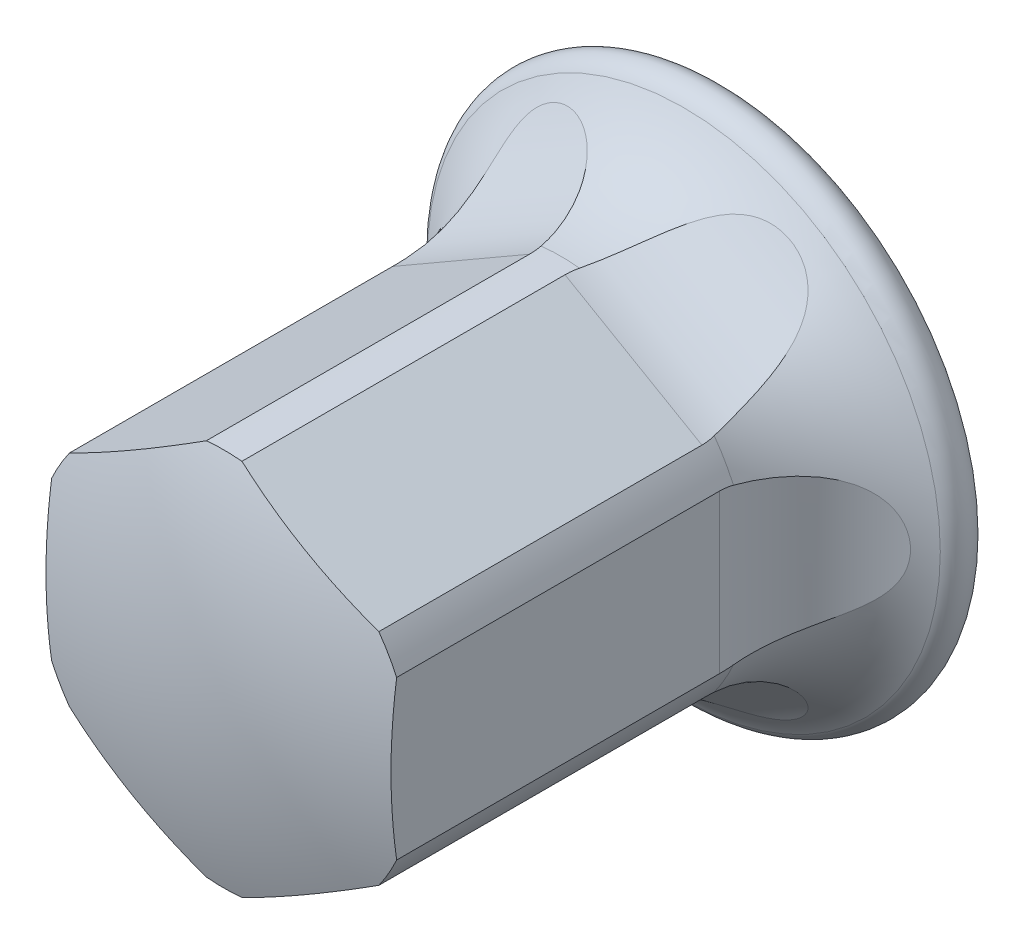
ISO-10303-21;
HEADER;
FILE_DESCRIPTION(('STEP AP214'),'2;1');
FILE_NAME('part.step','',(''),(''),'','','');
FILE_SCHEMA(('AUTOMOTIVE_DESIGN { 1 0 10303 214 1 1 1 1 }'));
ENDSEC;
DATA;
#1=APPLICATION_CONTEXT('core data for automotive mechanical design processes');
#2=APPLICATION_PROTOCOL_DEFINITION('international standard','automotive_design',2000,#1);
#3=PRODUCT_CONTEXT('',#1,'mechanical');
#4=PRODUCT('Part','Part','',(#3));
#5=PRODUCT_RELATED_PRODUCT_CATEGORY('part','',(#4));
#6=PRODUCT_DEFINITION_FORMATION('','',#4);
#7=PRODUCT_DEFINITION_CONTEXT('part definition',#1,'design');
#8=PRODUCT_DEFINITION('design','',#6,#7);
#9=PRODUCT_DEFINITION_SHAPE('','',#8);
#10=(LENGTH_UNIT() NAMED_UNIT(*) SI_UNIT(.MILLI.,.METRE.));
#11=(NAMED_UNIT(*) PLANE_ANGLE_UNIT() SI_UNIT($,.RADIAN.));
#12=(NAMED_UNIT(*) SI_UNIT($,.STERADIAN.) SOLID_ANGLE_UNIT());
#13=UNCERTAINTY_MEASURE_WITH_UNIT(LENGTH_MEASURE(1.E-05),#10,'distance_accuracy_value','');
#14=(GEOMETRIC_REPRESENTATION_CONTEXT(3) GLOBAL_UNCERTAINTY_ASSIGNED_CONTEXT((#13)) GLOBAL_UNIT_ASSIGNED_CONTEXT((#10,
#11,#12)) REPRESENTATION_CONTEXT('',''));
#15=CARTESIAN_POINT('',(0.,0.,0.));
#16=DIRECTION('',(0.,0.,1.));
#17=DIRECTION('',(1.,0.,0.));
#18=AXIS2_PLACEMENT_3D('',#15,#16,#17);
#19=CARTESIAN_POINT('',(0.,0.,0.));
#20=DIRECTION('',(0.,0.,1.));
#21=DIRECTION('',(1.,0.,0.));
#22=AXIS2_PLACEMENT_3D('',#19,#20,#21);
#23=CYLINDRICAL_SURFACE('',#22,3.85);
#24=DIRECTION('',(0.,0.,-1.));
#25=VECTOR('',#24,1.);
#26=CARTESIAN_POINT('',(0.360980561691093,3.8330396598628,13.6));
#27=LINE('',#26,#25);
#28=CARTESIAN_POINT('',(0.360980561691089,3.83303965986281,10.1545486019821));
#29=VERTEX_POINT('',#28);
#30=CARTESIAN_POINT('',(0.360980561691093,3.8330396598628,3.6));
#31=VERTEX_POINT('',#30);
#32=EDGE_CURVE('E177',#29,#31,#27,.T.);
#33=ORIENTED_EDGE('',*,*,#32,.T.);
#34=CARTESIAN_POINT('',(3.1390194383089,2.22913816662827,3.6));
#35=CARTESIAN_POINT('',(3.13901702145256,2.229147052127,3.67194253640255));
#36=CARTESIAN_POINT('',(3.13541679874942,2.23423896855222,3.74397921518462));
#37=CARTESIAN_POINT('',(3.12099145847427,2.25434161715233,3.88603168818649));
#38=CARTESIAN_POINT('',(3.11014922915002,2.26937584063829,3.9560422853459));
#39=CARTESIAN_POINT('',(3.08128100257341,2.3084174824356,4.09176728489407));
#40=CARTESIAN_POINT('',(3.06327225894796,2.3324033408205,4.15749156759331));
#41=CARTESIAN_POINT('',(3.02018445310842,2.38793080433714,4.28310529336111));
#42=CARTESIAN_POINT('',(2.99510870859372,2.41946886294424,4.34299745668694));
#43=CARTESIAN_POINT('',(2.93738944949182,2.48924446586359,4.4571928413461));
#44=CARTESIAN_POINT('',(2.90456837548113,2.52763305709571,4.51131337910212));
#45=CARTESIAN_POINT('',(2.83216508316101,2.60850257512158,4.61133711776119));
#46=CARTESIAN_POINT('',(2.7925801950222,2.65098511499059,4.65723705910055));
#47=CARTESIAN_POINT('',(2.70332886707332,2.74206718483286,4.7442612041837));
#48=CARTESIAN_POINT('',(2.65307134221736,2.79087072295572,4.78456396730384));
#49=CARTESIAN_POINT('',(2.54611573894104,2.88878188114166,4.8549341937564));
#50=CARTESIAN_POINT('',(2.48941454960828,2.93788963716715,4.88499668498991));
#51=CARTESIAN_POINT('',(2.36345626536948,3.04038153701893,4.9381152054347));
#52=CARTESIAN_POINT('',(2.29350853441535,3.09357478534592,4.95990342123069));
#53=CARTESIAN_POINT('',(2.14827620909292,3.19614287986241,4.99131771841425));
#54=CARTESIAN_POINT('',(2.07298881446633,3.24551569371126,5.00093736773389));
#55=CARTESIAN_POINT('',(1.9112483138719,3.3435606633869,5.00856717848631));
#56=CARTESIAN_POINT('',(1.82441766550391,3.39170893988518,5.00537206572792));
#57=CARTESIAN_POINT('',(1.64865289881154,3.48053820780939,4.98451364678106));
#58=CARTESIAN_POINT('',(1.55971807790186,3.52121666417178,4.96684543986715));
#59=CARTESIAN_POINT('',(1.38125299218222,3.59501064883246,4.91620079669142));
#60=CARTESIAN_POINT('',(1.29173556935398,3.62799633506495,4.88298657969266));
#61=CARTESIAN_POINT('',(1.11737081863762,3.68543011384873,4.80063426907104));
#62=CARTESIAN_POINT('',(1.03252073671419,3.70988328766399,4.75150568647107));
#63=CARTESIAN_POINT('',(0.878749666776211,3.7491440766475,4.6420366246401));
#64=CARTESIAN_POINT('',(0.809091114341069,3.76458376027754,4.58296498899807));
#65=CARTESIAN_POINT('',(0.681520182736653,3.78975790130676,4.45224617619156));
#66=CARTESIAN_POINT('',(0.623595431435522,3.79949838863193,4.38061239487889));
#67=CARTESIAN_POINT('',(0.529690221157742,3.81364621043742,4.23681469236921));
#68=CARTESIAN_POINT('',(0.49183908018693,3.81858096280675,4.1659215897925));
#69=CARTESIAN_POINT('',(0.429786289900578,3.82606465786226,4.01827105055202));
#70=CARTESIAN_POINT('',(0.405577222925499,3.82861489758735,3.94151682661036));
#71=CARTESIAN_POINT('',(0.373628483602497,3.83185774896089,3.79204404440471));
#72=CARTESIAN_POINT('',(0.364574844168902,3.83270010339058,3.71960695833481));
#73=CARTESIAN_POINT('',(0.359141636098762,3.8332137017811,3.5742627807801));
#74=CARTESIAN_POINT('',(0.362758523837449,3.83288527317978,3.50135582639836));
#75=CARTESIAN_POINT('',(0.382186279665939,3.83099479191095,3.35958702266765));
#76=CARTESIAN_POINT('',(0.39760479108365,3.8294723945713,3.29067031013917));
#77=CARTESIAN_POINT('',(0.439524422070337,3.82488680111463,3.15636259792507));
#78=CARTESIAN_POINT('',(0.466025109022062,3.8218236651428,3.09097146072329));
#79=CARTESIAN_POINT('',(0.529510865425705,3.81354850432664,2.96439350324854));
#80=CARTESIAN_POINT('',(0.566650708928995,3.80830419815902,2.90328668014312));
#81=CARTESIAN_POINT('',(0.649718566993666,3.79501387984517,2.78773241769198));
#82=CARTESIAN_POINT('',(0.695648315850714,3.78696731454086,2.73328629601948));
#83=CARTESIAN_POINT('',(0.79757336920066,3.76685937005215,2.62882717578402));
#84=CARTESIAN_POINT('',(0.854013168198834,3.75458207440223,2.57929068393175));
#85=CARTESIAN_POINT('',(0.972636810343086,3.72561510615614,2.48922576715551));
#86=CARTESIAN_POINT('',(1.0348229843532,3.70892363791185,2.44870102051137));
#87=CARTESIAN_POINT('',(1.1696369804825,3.66877274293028,2.37296481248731));
#88=CARTESIAN_POINT('',(1.24267445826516,3.64478533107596,2.33876386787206));
#89=CARTESIAN_POINT('',(1.39081648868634,3.59087120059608,2.28127567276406));
#90=CARTESIAN_POINT('',(1.46592208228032,3.56094144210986,2.25799402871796));
#91=CARTESIAN_POINT('',(1.62505541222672,3.49143046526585,2.21990499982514));
#92=CARTESIAN_POINT('',(1.70908700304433,3.45112618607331,2.20642679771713));
#93=CARTESIAN_POINT('',(1.87482545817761,3.36397260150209,2.19242770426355));
#94=CARTESIAN_POINT('',(1.95653110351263,3.31711993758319,2.19191348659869));
#95=CARTESIAN_POINT('',(2.12137329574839,3.21439899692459,2.20427416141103));
#96=CARTESIAN_POINT('',(2.20418685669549,3.15812394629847,2.21811891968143));
#97=CARTESIAN_POINT('',(2.36265013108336,3.04139215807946,2.26108825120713));
#98=CARTESIAN_POINT('',(2.43829918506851,2.98093503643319,2.29021422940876));
#99=CARTESIAN_POINT('',(2.57888476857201,2.86011531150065,2.36351605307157));
#100=CARTESIAN_POINT('',(2.64401443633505,2.79977788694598,2.40735968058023));
#101=CARTESIAN_POINT('',(2.76363868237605,2.68176275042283,2.51045340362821));
#102=CARTESIAN_POINT('',(2.81814422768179,2.62408234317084,2.56968746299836));
#103=CARTESIAN_POINT('',(2.90975373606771,2.52191054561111,2.69551252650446));
#104=CARTESIAN_POINT('',(2.9481129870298,2.47666623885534,2.76057515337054));
#105=CARTESIAN_POINT('',(3.01459832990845,2.39530192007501,2.9009176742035));
#106=CARTESIAN_POINT('',(3.04272762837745,2.35917905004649,2.97619435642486));
#107=CARTESIAN_POINT('',(3.08558231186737,2.3027773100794,3.12466175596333));
#108=CARTESIAN_POINT('',(3.10152954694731,2.28109748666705,3.19697338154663));
#109=CARTESIAN_POINT('',(3.12518710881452,2.24858237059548,3.34514717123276));
#110=CARTESIAN_POINT('',(3.13292148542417,2.23771542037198,3.42099828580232));
#111=CARTESIAN_POINT('',(3.13820517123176,2.23028336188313,3.53147356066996));
#112=CARTESIAN_POINT('',(3.13902058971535,2.22913393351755,3.56572609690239));
#113=CARTESIAN_POINT('',(3.1390194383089,2.22913816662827,3.6));
#114=B_SPLINE_CURVE_WITH_KNOTS('',3,(#34,#35,#36,#37,#38,#39,#40,#41,#42,#43,#44,#45,#46,#47,
#48,#49,#50,#51,#52,#53,#54,#55,#56,#57,#58,#59,#60,#61,#62,#63,#64,#65,#66,#67,#68,#69,#70,#71,
#72,#73,#74,#75,#76,#77,#78,#79,#80,#81,#82,#83,#84,#85,#86,#87,#88,#89,#90,#91,#92,#93,#94,#95,
#96,#97,#98,#99,#100,#101,#102,#103,#104,#105,#106,#107,#108,#109,#110,#111,#112,#113),
.UNSPECIFIED.,.T.,.F.,(4,2,2,2,2,2,2,2,2,2,2,2,2,2,2,2,2,2,2,2,2,2,2,2,2,2,2,2,2,2,2,2,2,2,2,2,
2,2,2,4),(0.,0.215724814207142,0.431961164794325,0.647680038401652,0.863297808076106,
1.0844442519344,1.30567818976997,1.54715796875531,1.78875483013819,2.05924364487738,
2.32987537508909,2.6265301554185,2.92328542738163,3.22473589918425,3.52600654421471,
3.80227469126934,4.07825000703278,4.31847424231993,4.55856773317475,4.77649887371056,
4.99436906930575,5.2052946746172,5.4162120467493,5.63036880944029,5.84456787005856,
6.0719005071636,6.2993257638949,6.55072657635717,6.80225632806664,7.08355740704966,
7.36500329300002,7.6667798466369,7.96858415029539,8.26398889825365,8.55908707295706,
8.82168999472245,9.08421053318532,9.31449214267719,9.54409753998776,9.64687027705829),.UNSPECIFIED.);
#115=CARTESIAN_POINT('',(0.389677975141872,3.83022859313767,3.3328978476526));
#116=VERTEX_POINT('',#115);
#117=EDGE_CURVE('E420',#31,#116,#114,.T.);
#118=ORIENTED_EDGE('',*,*,#117,.T.);
#119=CARTESIAN_POINT('',(0.,0.,3.3328978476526));
#120=DIRECTION('',(0.,0.,1.));
#121=DIRECTION('',(1.,0.,0.));
#122=AXIS2_PLACEMENT_3D('',#119,#120,#121);
#123=CIRCLE('',#122,3.85);
#124=CARTESIAN_POINT('',(-0.389677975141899,3.83022859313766,3.3328978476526));
#125=VERTEX_POINT('',#124);
#126=EDGE_CURVE('E299',#125,#116,#123,.F.);
#127=ORIENTED_EDGE('',*,*,#126,.F.);
#128=CARTESIAN_POINT('',(-0.360980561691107,3.8330396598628,3.6));
#129=CARTESIAN_POINT('',(-0.360989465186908,3.83304200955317,3.67194253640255));
#130=CARTESIAN_POINT('',(-0.367199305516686,3.83247008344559,3.74397921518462));
#131=CARTESIAN_POINT('',(-0.391821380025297,3.83002869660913,3.88603168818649));
#132=CARTESIAN_POINT('',(-0.410262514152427,3.82815616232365,3.9560422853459));
#133=CARTESIAN_POINT('',(-0.458507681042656,3.82267636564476,4.09176728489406));
#134=CARTESIAN_POINT('',(-0.488284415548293,3.81907326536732,4.15749156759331));
#135=CARTESIAN_POINT('',(-0.557916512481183,3.80952186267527,4.2831052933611));
#136=CARTESIAN_POINT('',(-0.597767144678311,3.80357466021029,4.34299745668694));
#137=CARTESIAN_POINT('',(-0.687054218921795,3.7884761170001,4.45719284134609));
#138=CARTESIAN_POINT('',(-0.736710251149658,3.77924652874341,4.51131337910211));
#139=CARTESIAN_POINT('',(-0.842946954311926,3.75697819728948,4.61133711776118));
#140=CARTESIAN_POINT('',(-0.899530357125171,3.74393794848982,4.65723705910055));
#141=CARTESIAN_POINT('',(-1.02303540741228,3.71218506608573,4.7442612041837));
#142=CARTESIAN_POINT('',(-1.09042927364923,3.69306254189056,4.78456396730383));
#143=CARTESIAN_POINT('',(-1.22870062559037,3.64939185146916,4.85493419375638));
#144=CARTESIAN_POINT('',(-1.29957978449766,3.62484105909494,4.88499668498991));
#145=CARTESIAN_POINT('',(-1.45131951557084,3.56700393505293,4.9381152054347));
#146=CARTESIAN_POINT('',(-1.53236008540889,3.53302404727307,4.95990342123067));
#147=CARTESIAN_POINT('',(-1.69380282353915,3.4585332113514,4.99131771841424));
#148=CARTESIAN_POINT('',(-1.77420463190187,3.41801882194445,5.00093736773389));
#149=CARTESIAN_POINT('',(-1.93998431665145,3.32696992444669,5.00856717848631));
#150=CARTESIAN_POINT('',(-2.0250972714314,3.27584651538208,5.0053720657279));
#151=CARTESIAN_POINT('',(-2.18990805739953,3.16804439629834,4.98451364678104));
#152=CARTESIAN_POINT('',(-2.26960404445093,3.11136381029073,4.96684543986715));
#153=CARTESIAN_POINT('',(-2.42274405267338,2.9937055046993,4.91620079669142));
#154=CARTESIAN_POINT('',(-2.49606920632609,2.93267398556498,4.88298657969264));
#155=CARTESIAN_POINT('',(-2.63299069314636,2.81038657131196,4.80063426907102));
#156=CARTESIAN_POINT('',(-2.69659280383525,2.7491308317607,4.75150568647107));
#157=CARTESIAN_POINT('',(-2.80747917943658,2.63559157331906,4.6420366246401));
#158=CARTESIAN_POINT('',(-2.85567961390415,2.58298533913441,4.58296498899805));
#159=CARTESIAN_POINT('',(-2.94126652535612,2.48509274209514,4.45224617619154));
#160=CARTESIAN_POINT('',(-2.97866441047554,2.43979867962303,4.3806123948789));
#161=CARTESIAN_POINT('',(-3.03786938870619,2.3655482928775,4.23681469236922));
#162=CARTESIAN_POINT('',(-3.06106858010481,2.33523561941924,4.16592158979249));
#163=CARTESIAN_POINT('',(-3.09857604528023,2.28523817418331,4.01827105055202));
#164=CARTESIAN_POINT('',(-3.11288915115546,2.2655476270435,3.94151682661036));
#165=CARTESIAN_POINT('',(-3.13167191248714,2.23950063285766,3.79204404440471));
#166=CARTESIAN_POINT('',(-3.13692823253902,2.23208112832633,3.71960695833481));
#167=CARTESIAN_POINT('',(-3.14008962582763,2.2276326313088,3.5742627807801));
#168=CARTESIAN_POINT('',(-3.13799675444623,2.23060073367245,3.50135582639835));
#169=CARTESIAN_POINT('',(-3.1266456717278,2.24648042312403,3.35958702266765));
#170=CARTESIAN_POINT('',(-3.11761798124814,2.25907204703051,3.29067031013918));
#171=CARTESIAN_POINT('',(-3.09268692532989,2.29308271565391,3.15636259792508));
#172=CARTESIAN_POINT('',(-3.07678382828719,2.31450141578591,3.09097146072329));
#173=CARTESIAN_POINT('',(-3.03787445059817,2.36534411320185,2.96439350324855));
#174=CARTESIAN_POINT('',(-3.01476282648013,2.39488600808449,2.90328668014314));
#175=CARTESIAN_POINT('',(-2.96171914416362,2.46017972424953,2.78773241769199));
#176=CARTESIAN_POINT('',(-2.93178573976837,2.49593277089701,2.73328629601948));
#177=CARTESIAN_POINT('',(-2.86340922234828,2.57414848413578,2.62882717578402));
#178=CARTESIAN_POINT('',(-2.82455687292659,2.61688813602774,2.57929068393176));
#179=CARTESIAN_POINT('',(-2.74015892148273,2.70513573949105,2.48922576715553));
#180=CARTESIAN_POINT('',(-2.69461059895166,2.75064481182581,2.44870102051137));
#181=CARTESIAN_POINT('',(-2.5924319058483,2.8473217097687,2.37296481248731));
#182=CARTESIAN_POINT('',(-2.53513945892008,2.89858031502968,2.33876386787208));
#183=CARTESIAN_POINT('',(-2.41437743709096,2.99991801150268,2.28127567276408));
#184=CARTESIAN_POINT('',(-2.35090470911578,3.04999648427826,2.25799402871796));
#185=CARTESIAN_POINT('',(-2.2111397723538,3.15305450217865,2.21990499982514));
#186=CARTESIAN_POINT('',(-2.13421944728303,3.20567585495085,2.20642679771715));
#187=CARTESIAN_POINT('',(-1.97587300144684,3.30563277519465,2.19242770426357));
#188=CARTESIAN_POINT('',(-1.89444458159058,3.35296560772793,2.19191348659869));
#189=CARTESIAN_POINT('',(-1.72306454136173,3.44436266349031,2.20427416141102));
#190=CARTESIAN_POINT('',(-1.63292213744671,3.4879437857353,2.21811891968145));
#191=CARTESIAN_POINT('',(-1.45259780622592,3.56681111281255,2.26108825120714));
#192=CARTESIAN_POINT('',(-1.36241587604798,3.60209655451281,2.29021422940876));
#193=CARTESIAN_POINT('',(-1.18749013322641,3.66343737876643,2.36351605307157));
#194=CARTESIAN_POINT('',(-1.10267155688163,3.68967261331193,2.40735968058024));
#195=CARTESIAN_POINT('',(-0.940655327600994,3.73426268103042,2.51045340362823));
#196=CARTESIAN_POINT('',(-0.863449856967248,3.75262566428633,2.56968746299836));
#197=CARTESIAN_POINT('',(-0.729161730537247,3.78087592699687,2.69551252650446));
#198=CARTESIAN_POINT('',(-0.670799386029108,3.79147385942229,2.76057515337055));
#199=CARTESIAN_POINT('',(-0.567093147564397,3.80836969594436,2.90091767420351));
#200=CARTESIAN_POINT('',(-0.521745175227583,3.8146689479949,2.97619435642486));
#201=CARTESIAN_POINT('',(-0.451472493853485,3.82358132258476,3.12466175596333));
#202=CARTESIAN_POINT('',(-0.424723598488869,3.82655212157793,3.19697338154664));
#203=CARTESIAN_POINT('',(-0.38473590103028,3.83078261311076,3.34514717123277));
#204=CARTESIAN_POINT('',(-0.371457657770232,3.8320473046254,3.42099828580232));
#205=CARTESIAN_POINT('',(-0.362379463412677,3.83290708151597,3.53147356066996));
#206=CARTESIAN_POINT('',(-0.360976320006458,3.83303854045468,3.56572609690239));
#207=CARTESIAN_POINT('',(-0.360980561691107,3.8330396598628,3.6));
#208=B_SPLINE_CURVE_WITH_KNOTS('',3,(#128,#129,#130,#131,#132,#133,#134,#135,#136,#137,#138,
#139,#140,#141,#142,#143,#144,#145,#146,#147,#148,#149,#150,#151,#152,#153,#154,#155,#156,#157,
#158,#159,#160,#161,#162,#163,#164,#165,#166,#167,#168,#169,#170,#171,#172,#173,#174,#175,#176,
#177,#178,#179,#180,#181,#182,#183,#184,#185,#186,#187,#188,#189,#190,#191,#192,#193,#194,#195,
#196,#197,#198,#199,#200,#201,#202,#203,#204,#205,#206,#207),.UNSPECIFIED.,.T.,.F.,(4,2,2,2,2,2,
2,2,2,2,2,2,2,2,2,2,2,2,2,2,2,2,2,2,2,2,2,2,2,2,2,2,2,2,2,2,2,2,2,4),(0.,0.215724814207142,
0.431961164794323,0.647680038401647,0.8632978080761,1.08444425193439,1.30567818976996,
1.5471579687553,1.78875483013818,2.05924364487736,2.32987537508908,2.62653015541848,
2.92328542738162,3.22473589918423,3.52600654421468,3.80227469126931,4.07825000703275,
4.3184742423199,4.55856773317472,4.77649887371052,4.99436906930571,5.20529467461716,
5.41621204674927,5.63036880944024,5.84456787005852,6.07190050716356,6.29932576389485,
6.55072657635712,6.80225632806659,7.08355740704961,7.36500329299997,7.66677984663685,
7.96858415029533,8.26398889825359,8.55908707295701,8.8216899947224,9.08421053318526,
9.31449214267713,9.5440975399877,9.64687027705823),.UNSPECIFIED.);
#209=CARTESIAN_POINT('',(-0.360980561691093,3.83303965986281,3.6));
#210=VERTEX_POINT('',#209);
#211=EDGE_CURVE('E382',#125,#210,#208,.T.);
#212=ORIENTED_EDGE('',*,*,#211,.T.);
#213=DIRECTION('',(0.,0.,-1.));
#214=VECTOR('',#213,1.);
#215=CARTESIAN_POINT('',(-0.360980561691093,3.83303965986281,13.6));
#216=LINE('',#215,#214);
#217=CARTESIAN_POINT('',(-0.360980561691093,3.8330396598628,10.1545486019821));
#218=VERTEX_POINT('',#217);
#219=EDGE_CURVE('E194',#218,#210,#216,.T.);
#220=ORIENTED_EDGE('',*,*,#219,.F.);
#221=CARTESIAN_POINT('',(0.,0.,10.1545486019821));
#222=DIRECTION('',(0.,0.,1.));
#223=DIRECTION('',(1.,0.,0.));
#224=AXIS2_PLACEMENT_3D('',#221,#222,#223);
#225=CIRCLE('',#224,3.85);
#226=EDGE_CURVE('E223',#29,#218,#225,.T.);
#227=ORIENTED_EDGE('',*,*,#226,.F.);
#228=EDGE_LOOP('',(#33,#118,#127,#212,#220,#227));
#229=FACE_BOUND('',#228,.T.);
#230=ADVANCED_FACE('F16',(#229),#23,.T.);
#231=DIRECTION('',(0.,0.,-1.));
#232=VECTOR('',#231,1.);
#233=CARTESIAN_POINT('',(3.13901943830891,-2.22913816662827,13.6));
#234=LINE('',#233,#232);
#235=CARTESIAN_POINT('',(3.13901943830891,-2.22913816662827,10.1545486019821));
#236=VERTEX_POINT('',#235);
#237=CARTESIAN_POINT('',(3.13901943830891,-2.22913816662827,3.6));
#238=VERTEX_POINT('',#237);
#239=EDGE_CURVE('E32',#236,#238,#234,.T.);
#240=ORIENTED_EDGE('',*,*,#239,.T.);
#241=CARTESIAN_POINT('',(0.360980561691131,-3.8330396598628,3.6));
#242=CARTESIAN_POINT('',(0.360989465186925,-3.83304200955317,3.67194253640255));
#243=CARTESIAN_POINT('',(0.367199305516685,-3.83247008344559,3.74397921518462));
#244=CARTESIAN_POINT('',(0.391821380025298,-3.83002869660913,3.88603168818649));
#245=CARTESIAN_POINT('',(0.410262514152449,-3.82815616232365,3.9560422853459));
#246=CARTESIAN_POINT('',(0.458507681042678,-3.82267636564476,4.09176728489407));
#247=CARTESIAN_POINT('',(0.488284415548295,-3.81907326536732,4.15749156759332));
#248=CARTESIAN_POINT('',(0.557916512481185,-3.80952186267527,4.28310529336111));
#249=CARTESIAN_POINT('',(0.597767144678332,-3.80357466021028,4.34299745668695));
#250=CARTESIAN_POINT('',(0.68705421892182,-3.7884761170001,4.4571928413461));
#251=CARTESIAN_POINT('',(0.736710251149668,-3.77924652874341,4.51131337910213));
#252=CARTESIAN_POINT('',(0.842946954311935,-3.75697819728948,4.6113371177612));
#253=CARTESIAN_POINT('',(0.899530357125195,-3.74393794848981,4.65723705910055));
#254=CARTESIAN_POINT('',(1.02303540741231,-3.71218506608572,4.7442612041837));
#255=CARTESIAN_POINT('',(1.09042927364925,-3.69306254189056,4.78456396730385));
#256=CARTESIAN_POINT('',(1.22870062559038,-3.64939185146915,4.8549341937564));
#257=CARTESIAN_POINT('',(1.29957978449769,-3.62484105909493,4.88499668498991));
#258=CARTESIAN_POINT('',(1.45131951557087,-3.56700393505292,4.9381152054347));
#259=CARTESIAN_POINT('',(1.53236008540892,-3.53302404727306,4.9599034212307));
#260=CARTESIAN_POINT('',(1.69380282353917,-3.45853321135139,4.99131771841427));
#261=CARTESIAN_POINT('',(1.7742046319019,-3.41801882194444,5.0009373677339));
#262=CARTESIAN_POINT('',(1.93998431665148,-3.32696992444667,5.00856717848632));
#263=CARTESIAN_POINT('',(2.02509727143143,-3.27584651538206,5.00537206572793));
#264=CARTESIAN_POINT('',(2.18990805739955,-3.16804439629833,4.98451364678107));
#265=CARTESIAN_POINT('',(2.26960404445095,-3.11136381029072,4.96684543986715));
#266=CARTESIAN_POINT('',(2.4227440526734,-2.99370550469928,4.91620079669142));
#267=CARTESIAN_POINT('',(2.49606920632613,-2.93267398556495,4.88298657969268));
#268=CARTESIAN_POINT('',(2.63299069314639,-2.81038657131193,4.80063426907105));
#269=CARTESIAN_POINT('',(2.69659280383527,-2.74913083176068,4.75150568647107));
#270=CARTESIAN_POINT('',(2.8074791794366,-2.63559157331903,4.6420366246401));
#271=CARTESIAN_POINT('',(2.8556796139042,-2.58298533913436,4.58296498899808));
#272=CARTESIAN_POINT('',(2.94126652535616,-2.4850927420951,4.45224617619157));
#273=CARTESIAN_POINT('',(2.97866441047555,-2.43979867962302,4.38061239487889));
#274=CARTESIAN_POINT('',(3.03786938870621,-2.36554829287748,4.23681469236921));
#275=CARTESIAN_POINT('',(3.06106858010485,-2.33523561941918,4.16592158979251));
#276=CARTESIAN_POINT('',(3.09857604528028,-2.28523817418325,4.01827105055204));
#277=CARTESIAN_POINT('',(3.11288915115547,-2.26554762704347,3.94151682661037));
#278=CARTESIAN_POINT('',(3.13167191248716,-2.23950063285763,3.79204404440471));
#279=CARTESIAN_POINT('',(3.13692823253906,-2.23208112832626,3.71960695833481));
#280=CARTESIAN_POINT('',(3.14008962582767,-2.22763263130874,3.5742627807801));
#281=CARTESIAN_POINT('',(3.13799675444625,-2.23060073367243,3.50135582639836));
#282=CARTESIAN_POINT('',(3.12664567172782,-2.24648042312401,3.35958702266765));
#283=CARTESIAN_POINT('',(3.11761798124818,-2.25907204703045,3.29067031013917));
#284=CARTESIAN_POINT('',(3.09268692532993,-2.29308271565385,3.15636259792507));
#285=CARTESIAN_POINT('',(3.07678382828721,-2.31450141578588,3.09097146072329));
#286=CARTESIAN_POINT('',(3.03787445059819,-2.36534411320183,2.96439350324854));
#287=CARTESIAN_POINT('',(3.01476282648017,-2.39488600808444,2.90328668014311));
#288=CARTESIAN_POINT('',(2.96171914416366,-2.46017972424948,2.78773241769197));
#289=CARTESIAN_POINT('',(2.93178573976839,-2.49593277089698,2.73328629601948));
#290=CARTESIAN_POINT('',(2.8634092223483,-2.57414848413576,2.62882717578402));
#291=CARTESIAN_POINT('',(2.82455687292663,-2.61688813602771,2.57929068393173));
#292=CARTESIAN_POINT('',(2.74015892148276,-2.70513573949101,2.4892257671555));
#293=CARTESIAN_POINT('',(2.69461059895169,-2.75064481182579,2.44870102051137));
#294=CARTESIAN_POINT('',(2.59243190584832,-2.84732170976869,2.37296481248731));
#295=CARTESIAN_POINT('',(2.53513945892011,-2.89858031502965,2.33876386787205));
#296=CARTESIAN_POINT('',(2.414377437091,-2.99991801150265,2.28127567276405));
#297=CARTESIAN_POINT('',(2.35090470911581,-3.04999648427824,2.25799402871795));
#298=CARTESIAN_POINT('',(2.21113977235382,-3.15305450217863,2.21990499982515));
#299=CARTESIAN_POINT('',(2.13421944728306,-3.20567585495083,2.20642679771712));
#300=CARTESIAN_POINT('',(1.97587300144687,-3.30563277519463,2.19242770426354));
#301=CARTESIAN_POINT('',(1.89444458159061,-3.35296560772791,2.19191348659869));
#302=CARTESIAN_POINT('',(1.72306454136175,-3.4443626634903,2.20427416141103));
#303=CARTESIAN_POINT('',(1.63292213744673,-3.48794378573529,2.21811891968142));
#304=CARTESIAN_POINT('',(1.45259780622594,-3.56681111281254,2.26108825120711));
#305=CARTESIAN_POINT('',(1.36241587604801,-3.6020965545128,2.29021422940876));
#306=CARTESIAN_POINT('',(1.18749013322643,-3.66343737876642,2.36351605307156));
#307=CARTESIAN_POINT('',(1.10267155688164,-3.68967261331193,2.40735968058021));
#308=CARTESIAN_POINT('',(0.940655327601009,-3.73426268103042,2.5104534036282));
#309=CARTESIAN_POINT('',(0.863449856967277,-3.75262566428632,2.56968746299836));
#310=CARTESIAN_POINT('',(0.72916173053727,-3.78087592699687,2.69551252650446));
#311=CARTESIAN_POINT('',(0.670799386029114,-3.79147385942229,2.76057515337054));
#312=CARTESIAN_POINT('',(0.567093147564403,-3.80836969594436,2.9009176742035));
#313=CARTESIAN_POINT('',(0.521745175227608,-3.81466894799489,2.97619435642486));
#314=CARTESIAN_POINT('',(0.451472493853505,-3.82358132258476,3.12466175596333));
#315=CARTESIAN_POINT('',(0.42472359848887,-3.82655212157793,3.19697338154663));
#316=CARTESIAN_POINT('',(0.384735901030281,-3.83078261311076,3.34514717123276));
#317=CARTESIAN_POINT('',(0.371457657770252,-3.8320473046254,3.42099828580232));
#318=CARTESIAN_POINT('',(0.362379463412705,-3.83290708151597,3.53147356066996));
#319=CARTESIAN_POINT('',(0.360976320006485,-3.83303854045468,3.56572609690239));
#320=CARTESIAN_POINT('',(0.360980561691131,-3.8330396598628,3.6));
#321=B_SPLINE_CURVE_WITH_KNOTS('',3,(#241,#242,#243,#244,#245,#246,#247,#248,#249,#250,#251,
#252,#253,#254,#255,#256,#257,#258,#259,#260,#261,#262,#263,#264,#265,#266,#267,#268,#269,#270,
#271,#272,#273,#274,#275,#276,#277,#278,#279,#280,#281,#282,#283,#284,#285,#286,#287,#288,#289,
#290,#291,#292,#293,#294,#295,#296,#297,#298,#299,#300,#301,#302,#303,#304,#305,#306,#307,#308,
#309,#310,#311,#312,#313,#314,#315,#316,#317,#318,#319,#320),.UNSPECIFIED.,.T.,.F.,(4,2,2,2,2,2,
2,2,2,2,2,2,2,2,2,2,2,2,2,2,2,2,2,2,2,2,2,2,2,2,2,2,2,2,2,2,2,2,2,4),(0.,0.215724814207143,
0.431961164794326,0.647680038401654,0.863297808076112,1.0844442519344,1.30567818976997,
1.54715796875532,1.7887548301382,2.05924364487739,2.3298753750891,2.62653015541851,
2.92328542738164,3.22473589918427,3.52600654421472,3.80227469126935,4.0782500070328,
4.31847424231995,4.55856773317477,4.77649887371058,4.99436906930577,5.20529467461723,
5.41621204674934,5.63036880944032,5.84456787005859,6.07190050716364,6.29932576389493,
6.5507265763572,6.80225632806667,7.0835574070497,7.36500329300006,7.66677984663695,
7.96858415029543,8.26398889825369,8.55908707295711,8.8216899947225,9.08421053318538,
9.31449214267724,9.54409753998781,9.64687027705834),.UNSPECIFIED.);
#322=CARTESIAN_POINT('',(3.12223627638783,-2.25258532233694,3.3328978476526));
#323=VERTEX_POINT('',#322);
#324=EDGE_CURVE('E148',#238,#323,#321,.T.);
#325=ORIENTED_EDGE('',*,*,#324,.T.);
#326=CARTESIAN_POINT('',(3.51191425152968,-1.57764327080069,3.3328978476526));
#327=VERTEX_POINT('',#326);
#328=EDGE_CURVE('E225',#327,#323,#123,.F.);
#329=ORIENTED_EDGE('',*,*,#328,.F.);
#330=CARTESIAN_POINT('',(3.51191425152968,-1.57764327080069,3.3328978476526));
#331=CARTESIAN_POINT('',(3.50881429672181,-1.58453765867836,3.36754672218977));
#332=CARTESIAN_POINT('',(3.50630091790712,-1.59008539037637,3.40249951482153));
#333=CARTESIAN_POINT('',(3.50249174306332,-1.59846058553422,3.47279350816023));
#334=CARTESIAN_POINT('',(3.50119589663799,-1.60128816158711,3.50813469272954));
#335=CARTESIAN_POINT('',(3.49920435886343,-1.60564353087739,3.6142361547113));
#336=CARTESIAN_POINT('',(3.50038849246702,-1.60307921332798,3.68525251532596));
#337=CARTESIAN_POINT('',(3.50767891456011,-1.58706047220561,3.8257841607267));
#338=CARTESIAN_POINT('',(3.5137877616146,-1.57360038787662,3.89529864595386));
#339=CARTESIAN_POINT('',(3.53031911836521,-1.53615173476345,4.03088118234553));
#340=CARTESIAN_POINT('',(3.5407411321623,-1.51216437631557,4.09694962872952));
#341=CARTESIAN_POINT('',(3.56498507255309,-1.45408832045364,4.22444984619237));
#342=CARTESIAN_POINT('',(3.57883351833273,-1.41992038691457,4.28584031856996));
#343=CARTESIAN_POINT('',(3.60857956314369,-1.34252295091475,4.4020552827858));
#344=CARTESIAN_POINT('',(3.62447782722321,-1.29929050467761,4.45687763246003));
#345=CARTESIAN_POINT('',(3.65788904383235,-1.20213723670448,4.56210074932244));
#346=CARTESIAN_POINT('',(3.67544166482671,-1.1477311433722,4.61203964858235));
#347=CARTESIAN_POINT('',(3.70969021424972,-1.03167866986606,4.70296767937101));
#348=CARTESIAN_POINT('',(3.7263858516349,-0.970029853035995,4.74395378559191));
#349=CARTESIAN_POINT('',(3.75921615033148,-0.834356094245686,4.82066737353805));
#350=CARTESIAN_POINT('',(3.77511038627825,-0.759711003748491,4.85539951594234));
#351=CARTESIAN_POINT('',(3.80288382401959,-0.605574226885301,4.91400765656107));
#352=CARTESIAN_POINT('',(3.81476087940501,-0.526079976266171,4.9378778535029));
#353=CARTESIAN_POINT('',(3.83473090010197,-0.354469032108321,4.97727773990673));
#354=CARTESIAN_POINT('',(3.8422069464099,-0.261974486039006,4.9914802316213));
#355=CARTESIAN_POINT('',(3.85038987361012,-0.0755965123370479,5.00699640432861));
#356=CARTESIAN_POINT('',(3.85109326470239,0.0182876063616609,5.00830344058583));
#357=CARTESIAN_POINT('',(3.84546083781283,0.212149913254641,4.99766573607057));
#358=CARTESIAN_POINT('',(3.8385965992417,0.31206092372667,4.98472630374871));
#359=CARTESIAN_POINT('',(3.81761450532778,0.507958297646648,4.94362855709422));
#360=CARTESIAN_POINT('',(3.8034960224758,0.603944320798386,4.91546892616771));
#361=CARTESIAN_POINT('',(3.76981418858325,0.787089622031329,4.84403075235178));
#362=CARTESIAN_POINT('',(3.75035440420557,0.874377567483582,4.80103614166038));
#363=CARTESIAN_POINT('',(3.70823278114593,1.03859844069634,4.6995603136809));
#364=CARTESIAN_POINT('',(3.68557363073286,1.1155399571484,4.64109206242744));
#365=CARTESIAN_POINT('',(3.64272948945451,1.24793853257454,4.51643553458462));
#366=CARTESIAN_POINT('',(3.62254159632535,1.30481848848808,4.45176308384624));
#367=CARTESIAN_POINT('',(3.58483289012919,1.4051174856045,4.31204308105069));
#368=CARTESIAN_POINT('',(3.56730921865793,1.44855100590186,4.23700681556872));
#369=CARTESIAN_POINT('',(3.53926692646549,1.51566837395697,4.08889441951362));
#370=CARTESIAN_POINT('',(3.52814779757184,1.54113782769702,4.01673733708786));
#371=CARTESIAN_POINT('',(3.51111835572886,1.57955632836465,3.86857428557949));
#372=CARTESIAN_POINT('',(3.50520590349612,1.59251051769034,3.79256991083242));
#373=CARTESIAN_POINT('',(3.49976645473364,1.60442020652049,3.65197496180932));
#374=CARTESIAN_POINT('',(3.49934321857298,1.60534071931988,3.58758150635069));
#375=CARTESIAN_POINT('',(3.50179113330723,1.59998734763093,3.49148108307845));
#376=CARTESIAN_POINT('',(3.50312232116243,1.59707742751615,3.4595135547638));
#377=CARTESIAN_POINT('',(3.50678011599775,1.58902800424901,3.39591252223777));
#378=CARTESIAN_POINT('',(3.50910688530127,1.58388813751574,3.36427907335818));
#379=CARTESIAN_POINT('',(3.51191425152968,1.57764327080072,3.33289784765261));
#380=B_SPLINE_CURVE_WITH_KNOTS('',3,(#330,#331,#332,#333,#334,#335,#336,#337,#338,#339,#340,
#341,#342,#343,#344,#345,#346,#347,#348,#349,#350,#351,#352,#353,#354,#355,#356,#357,#358,#359,
#360,#361,#362,#363,#364,#365,#366,#367,#368,#369,#370,#371,#372,#373,#374,#375,#376,#377,#378,
#379),.UNSPECIFIED.,.F.,.F.,(4,2,2,2,2,2,2,2,2,2,2,2,2,2,2,2,2,2,2,2,2,2,2,2,4),(0.,
0.106327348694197,0.212650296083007,0.424756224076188,0.636972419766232,0.849164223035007,
1.06305270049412,1.27701074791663,1.50379095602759,1.73064767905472,1.98118194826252,
2.23184986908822,2.51228738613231,2.7928693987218,3.0943585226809,3.39587373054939,
3.69191181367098,3.98770261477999,4.25154670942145,4.51510570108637,4.7458515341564,
4.97650251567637,5.16890831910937,5.26520647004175,5.36152032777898),.UNSPECIFIED.);
#381=CARTESIAN_POINT('',(3.5,-1.60390149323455,3.6));
#382=VERTEX_POINT('',#381);
#383=EDGE_CURVE('E427',#327,#382,#380,.T.);
#384=ORIENTED_EDGE('',*,*,#383,.T.);
#385=DIRECTION('',(0.,0.,-1.));
#386=VECTOR('',#385,1.);
#387=CARTESIAN_POINT('',(3.5,-1.60390149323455,13.6));
#388=LINE('',#387,#386);
#389=CARTESIAN_POINT('',(3.5,-1.60390149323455,10.1545486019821));
#390=VERTEX_POINT('',#389);
#391=EDGE_CURVE('E436',#390,#382,#388,.T.);
#392=ORIENTED_EDGE('',*,*,#391,.F.);
#393=EDGE_CURVE('E224',#236,#390,#225,.T.);
#394=ORIENTED_EDGE('',*,*,#393,.F.);
#395=EDGE_LOOP('',(#240,#325,#329,#384,#392,#394));
#396=FACE_BOUND('',#395,.T.);
#397=ADVANCED_FACE('F265',(#396),#23,.T.);
#398=CARTESIAN_POINT('',(0.389677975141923,-3.83022859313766,3.3328978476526));
#399=VERTEX_POINT('',#398);
#400=CARTESIAN_POINT('',(-0.389677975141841,-3.83022859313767,3.3328978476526));
#401=VERTEX_POINT('',#400);
#402=EDGE_CURVE('E161',#399,#401,#123,.F.);
#403=ORIENTED_EDGE('',*,*,#402,.F.);
#404=CARTESIAN_POINT('',(0.360980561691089,-3.83303965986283,3.6));
#405=VERTEX_POINT('',#404);
#406=EDGE_CURVE('E145',#399,#405,#321,.T.);
#407=ORIENTED_EDGE('',*,*,#406,.T.);
#408=DIRECTION('',(0.,0.,-1.));
#409=VECTOR('',#408,1.);
#410=CARTESIAN_POINT('',(0.360980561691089,-3.8330396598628,13.6));
#411=LINE('',#410,#409);
#412=CARTESIAN_POINT('',(0.360980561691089,-3.8330396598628,10.1545486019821));
#413=VERTEX_POINT('',#412);
#414=EDGE_CURVE('E151',#413,#405,#411,.T.);
#415=ORIENTED_EDGE('',*,*,#414,.F.);
#416=CARTESIAN_POINT('',(-0.360980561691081,-3.83303965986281,10.1545486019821));
#417=VERTEX_POINT('',#416);
#418=EDGE_CURVE('E444',#417,#413,#225,.T.);
#419=ORIENTED_EDGE('',*,*,#418,.F.);
#420=DIRECTION('',(0.,0.,-1.));
#421=VECTOR('',#420,1.);
#422=CARTESIAN_POINT('',(-0.360980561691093,-3.83303965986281,13.6));
#423=LINE('',#422,#421);
#424=CARTESIAN_POINT('',(-0.360980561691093,-3.83303965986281,3.6));
#425=VERTEX_POINT('',#424);
#426=EDGE_CURVE('E40',#417,#425,#423,.T.);
#427=ORIENTED_EDGE('',*,*,#426,.T.);
#428=CARTESIAN_POINT('',(-3.13901943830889,-2.22913816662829,3.6));
#429=CARTESIAN_POINT('',(-3.13901702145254,-2.22914705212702,3.67194253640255));
#430=CARTESIAN_POINT('',(-3.1354167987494,-2.23423896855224,3.74397921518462));
#431=CARTESIAN_POINT('',(-3.12099145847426,-2.25434161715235,3.88603168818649));
#432=CARTESIAN_POINT('',(-3.11014922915,-2.26937584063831,3.9560422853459));
#433=CARTESIAN_POINT('',(-3.0812810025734,-2.30841748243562,4.09176728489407));
#434=CARTESIAN_POINT('',(-3.06327225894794,-2.33240334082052,4.15749156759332));
#435=CARTESIAN_POINT('',(-3.02018445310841,-2.38793080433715,4.28310529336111));
#436=CARTESIAN_POINT('',(-2.99510870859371,-2.41946886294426,4.34299745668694));
#437=CARTESIAN_POINT('',(-2.9373894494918,-2.48924446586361,4.4571928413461));
#438=CARTESIAN_POINT('',(-2.90456837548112,-2.52763305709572,4.51131337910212));
#439=CARTESIAN_POINT('',(-2.83216508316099,-2.60850257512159,4.61133711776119));
#440=CARTESIAN_POINT('',(-2.79258019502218,-2.6509851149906,4.65723705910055));
#441=CARTESIAN_POINT('',(-2.7033288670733,-2.74206718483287,4.7442612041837));
#442=CARTESIAN_POINT('',(-2.65307134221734,-2.79087072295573,4.78456396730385));
#443=CARTESIAN_POINT('',(-2.54611573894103,-2.88878188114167,4.8549341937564));
#444=CARTESIAN_POINT('',(-2.48941454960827,-2.93788963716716,4.88499668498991));
#445=CARTESIAN_POINT('',(-2.36345626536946,-3.04038153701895,4.9381152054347));
#446=CARTESIAN_POINT('',(-2.29350853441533,-3.09357478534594,4.95990342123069));
#447=CARTESIAN_POINT('',(-2.1482762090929,-3.19614287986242,4.99131771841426));
#448=CARTESIAN_POINT('',(-2.07298881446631,-3.24551569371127,5.0009373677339));
#449=CARTESIAN_POINT('',(-1.91124831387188,-3.3435606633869,5.00856717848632));
#450=CARTESIAN_POINT('',(-1.82441766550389,-3.39170893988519,5.00537206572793));
#451=CARTESIAN_POINT('',(-1.64865289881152,-3.4805382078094,4.98451364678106));
#452=CARTESIAN_POINT('',(-1.55971807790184,-3.52121666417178,4.96684543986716));
#453=CARTESIAN_POINT('',(-1.3812529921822,-3.59501064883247,4.91620079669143));
#454=CARTESIAN_POINT('',(-1.29173556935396,-3.62799633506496,4.88298657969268));
#455=CARTESIAN_POINT('',(-1.1173708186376,-3.68543011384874,4.80063426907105));
#456=CARTESIAN_POINT('',(-1.03252073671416,-3.70988328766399,4.75150568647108));
#457=CARTESIAN_POINT('',(-0.878749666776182,-3.7491440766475,4.64203662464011));
#458=CARTESIAN_POINT('',(-0.809091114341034,-3.76458376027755,4.58296498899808));
#459=CARTESIAN_POINT('',(-0.68152018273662,-3.78975790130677,4.45224617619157));
#460=CARTESIAN_POINT('',(-0.623595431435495,-3.79949838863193,4.3806123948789));
#461=CARTESIAN_POINT('',(-0.529690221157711,-3.81364621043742,4.23681469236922));
#462=CARTESIAN_POINT('',(-0.49183908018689,-3.81858096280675,4.16592158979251));
#463=CARTESIAN_POINT('',(-0.429786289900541,-3.82606465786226,4.01827105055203));
#464=CARTESIAN_POINT('',(-0.405577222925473,-3.82861489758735,3.94151682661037));
#465=CARTESIAN_POINT('',(-0.373628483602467,-3.83185774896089,3.79204404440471));
#466=CARTESIAN_POINT('',(-0.364574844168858,-3.83270010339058,3.71960695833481));
#467=CARTESIAN_POINT('',(-0.359141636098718,-3.8332137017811,3.57426278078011));
#468=CARTESIAN_POINT('',(-0.362758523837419,-3.83288527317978,3.50135582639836));
#469=CARTESIAN_POINT('',(-0.382186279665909,-3.83099479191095,3.35958702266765));
#470=CARTESIAN_POINT('',(-0.397604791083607,-3.8294723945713,3.29067031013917));
#471=CARTESIAN_POINT('',(-0.439524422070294,-3.82488680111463,3.15636259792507));
#472=CARTESIAN_POINT('',(-0.466025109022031,-3.8218236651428,3.09097146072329));
#473=CARTESIAN_POINT('',(-0.529510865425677,-3.81354850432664,2.96439350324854));
#474=CARTESIAN_POINT('',(-0.566650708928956,-3.80830419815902,2.90328668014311));
#475=CARTESIAN_POINT('',(-0.649718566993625,-3.79501387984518,2.78773241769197));
#476=CARTESIAN_POINT('',(-0.695648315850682,-3.78696731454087,2.73328629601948));
#477=CARTESIAN_POINT('',(-0.797573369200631,-3.76685937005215,2.62882717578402));
#478=CARTESIAN_POINT('',(-0.854013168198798,-3.75458207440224,2.57929068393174));
#479=CARTESIAN_POINT('',(-0.97263681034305,-3.72561510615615,2.4892257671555));
#480=CARTESIAN_POINT('',(-1.03482298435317,-3.70892363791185,2.44870102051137));
#481=CARTESIAN_POINT('',(-1.16963698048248,-3.66877274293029,2.37296481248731));
#482=CARTESIAN_POINT('',(-1.24267445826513,-3.64478533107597,2.33876386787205));
#483=CARTESIAN_POINT('',(-1.39081648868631,-3.59087120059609,2.28127567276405));
#484=CARTESIAN_POINT('',(-1.46592208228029,-3.56094144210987,2.25799402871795));
#485=CARTESIAN_POINT('',(-1.62505541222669,-3.49143046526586,2.21990499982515));
#486=CARTESIAN_POINT('',(-1.7090870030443,-3.45112618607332,2.20642679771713));
#487=CARTESIAN_POINT('',(-1.87482545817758,-3.3639726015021,2.19242770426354));
#488=CARTESIAN_POINT('',(-1.9565311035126,-3.3171199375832,2.19191348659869));
#489=CARTESIAN_POINT('',(-2.12137329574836,-3.2143989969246,2.20427416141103));
#490=CARTESIAN_POINT('',(-2.20418685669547,-3.15812394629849,2.21811891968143));
#491=CARTESIAN_POINT('',(-2.36265013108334,-3.04139215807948,2.26108825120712));
#492=CARTESIAN_POINT('',(-2.43829918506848,-2.98093503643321,2.29021422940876));
#493=CARTESIAN_POINT('',(-2.57888476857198,-2.86011531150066,2.36351605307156));
#494=CARTESIAN_POINT('',(-2.64401443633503,-2.799777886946,2.40735968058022));
#495=CARTESIAN_POINT('',(-2.76363868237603,-2.68176275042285,2.51045340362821));
#496=CARTESIAN_POINT('',(-2.81814422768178,-2.62408234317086,2.56968746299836));
#497=CARTESIAN_POINT('',(-2.90975373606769,-2.52191054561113,2.69551252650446));
#498=CARTESIAN_POINT('',(-2.94811298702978,-2.47666623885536,2.76057515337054));
#499=CARTESIAN_POINT('',(-3.01459832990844,-2.39530192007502,2.9009176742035));
#500=CARTESIAN_POINT('',(-3.04272762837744,-2.35917905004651,2.97619435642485));
#501=CARTESIAN_POINT('',(-3.08558231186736,-2.30277731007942,3.12466175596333));
#502=CARTESIAN_POINT('',(-3.10152954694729,-2.28109748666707,3.19697338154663));
#503=CARTESIAN_POINT('',(-3.12518710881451,-2.24858237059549,3.34514717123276));
#504=CARTESIAN_POINT('',(-3.13292148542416,-2.237715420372,3.42099828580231));
#505=CARTESIAN_POINT('',(-3.13820517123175,-2.23028336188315,3.53147356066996));
#506=CARTESIAN_POINT('',(-3.13902058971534,-2.22913393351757,3.56572609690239));
#507=CARTESIAN_POINT('',(-3.13901943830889,-2.22913816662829,3.6));
#508=B_SPLINE_CURVE_WITH_KNOTS('',3,(#428,#429,#430,#431,#432,#433,#434,#435,#436,#437,#438,
#439,#440,#441,#442,#443,#444,#445,#446,#447,#448,#449,#450,#451,#452,#453,#454,#455,#456,#457,
#458,#459,#460,#461,#462,#463,#464,#465,#466,#467,#468,#469,#470,#471,#472,#473,#474,#475,#476,
#477,#478,#479,#480,#481,#482,#483,#484,#485,#486,#487,#488,#489,#490,#491,#492,#493,#494,#495,
#496,#497,#498,#499,#500,#501,#502,#503,#504,#505,#506,#507),.UNSPECIFIED.,.T.,.F.,(4,2,2,2,2,2,
2,2,2,2,2,2,2,2,2,2,2,2,2,2,2,2,2,2,2,2,2,2,2,2,2,2,2,2,2,2,2,2,2,4),(0.,0.215724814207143,
0.431961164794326,0.647680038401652,0.863297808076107,1.0844442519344,1.30567818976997,
1.54715796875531,1.78875483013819,2.05924364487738,2.3298753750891,2.6265301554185,
2.92328542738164,3.22473589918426,3.52600654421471,3.80227469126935,4.07825000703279,
4.31847424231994,4.55856773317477,4.77649887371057,4.99436906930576,5.20529467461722,
5.41621204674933,5.63036880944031,5.84456787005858,6.07190050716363,6.29932576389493,
6.55072657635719,6.80225632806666,7.08355740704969,7.36500329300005,7.66677984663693,
7.96858415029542,8.26398889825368,8.5590870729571,8.82168999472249,9.08421053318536,
9.31449214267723,9.54409753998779,9.64687027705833),.UNSPECIFIED.);
#509=EDGE_CURVE('E329',#425,#401,#508,.T.);
#510=ORIENTED_EDGE('',*,*,#509,.T.);
#511=EDGE_LOOP('',(#403,#407,#415,#419,#427,#510));
#512=FACE_BOUND('',#511,.T.);
#513=ADVANCED_FACE('F156',(#512),#23,.T.);
#514=CARTESIAN_POINT('',(-3.51191425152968,1.57764327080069,3.3328978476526));
#515=VERTEX_POINT('',#514);
#516=CARTESIAN_POINT('',(-3.12223627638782,2.25258532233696,3.3328978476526));
#517=VERTEX_POINT('',#516);
#518=EDGE_CURVE('E302',#515,#517,#123,.F.);
#519=ORIENTED_EDGE('',*,*,#518,.F.);
#520=CARTESIAN_POINT('',(-3.85,0.,2.19376388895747));
#521=CARTESIAN_POINT('',(-3.84999671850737,0.0903864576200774,2.19376353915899));
#522=CARTESIAN_POINT('',(-3.84679332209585,0.180845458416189,2.19975573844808));
#523=CARTESIAN_POINT('',(-3.83420272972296,0.359802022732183,2.22388027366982));
#524=CARTESIAN_POINT('',(-3.82480660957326,0.448296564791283,2.24203013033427));
#525=CARTESIAN_POINT('',(-3.80055718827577,0.621201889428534,2.29089549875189));
#526=CARTESIAN_POINT('',(-3.78569328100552,0.705604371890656,2.32163544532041));
#527=CARTESIAN_POINT('',(-3.75187475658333,0.867630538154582,2.39605976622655));
#528=CARTESIAN_POINT('',(-3.73292152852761,0.945256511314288,2.43973974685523));
#529=CARTESIAN_POINT('',(-3.6926303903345,1.09218799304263,2.54090695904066));
#530=CARTESIAN_POINT('',(-3.67126006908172,1.16134587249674,2.59859772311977));
#531=CARTESIAN_POINT('',(-3.62913989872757,1.2869515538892,2.72668642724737));
#532=CARTESIAN_POINT('',(-3.60838959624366,1.34340885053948,2.79707480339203));
#533=CARTESIAN_POINT('',(-3.57286793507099,1.43500393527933,2.93925542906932));
#534=CARTESIAN_POINT('',(-3.5576747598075,1.47191276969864,3.00980278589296));
#535=CARTESIAN_POINT('',(-3.53193454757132,1.53265705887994,3.1571038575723));
#536=CARTESIAN_POINT('',(-3.52138471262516,1.55650038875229,3.23385380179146));
#537=CARTESIAN_POINT('',(-3.50697488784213,1.58868078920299,3.38342392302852));
#538=CARTESIAN_POINT('',(-3.50257419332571,1.5982766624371,3.45592389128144));
#539=CARTESIAN_POINT('',(-3.49911654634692,1.60583425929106,3.60164710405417));
#540=CARTESIAN_POINT('',(-3.50005807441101,1.60379929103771,3.67487013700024));
#541=CARTESIAN_POINT('',(-3.50705764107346,1.58843030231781,3.81726667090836));
#542=CARTESIAN_POINT('',(-3.5129362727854,1.57549242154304,3.88649237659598));
#543=CARTESIAN_POINT('',(-3.52899494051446,1.53918329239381,4.02161519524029));
#544=CARTESIAN_POINT('',(-3.53917474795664,1.51581259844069,4.08751248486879));
#545=CARTESIAN_POINT('',(-3.5630114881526,1.45890598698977,4.21511783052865));
#546=CARTESIAN_POINT('',(-3.5767116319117,1.42524267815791,4.27676078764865));
#547=CARTESIAN_POINT('',(-3.60622563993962,1.34881791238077,4.393538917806));
#548=CARTESIAN_POINT('',(-3.62203989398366,1.30605477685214,4.44867288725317));
#549=CARTESIAN_POINT('',(-3.65532999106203,1.20987349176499,4.55452293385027));
#550=CARTESIAN_POINT('',(-3.67284888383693,1.15597740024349,4.60479001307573));
#551=CARTESIAN_POINT('',(-3.70710872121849,1.0408898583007,4.69642951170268));
#552=CARTESIAN_POINT('',(-3.72384935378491,0.979695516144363,4.73779838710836));
#553=CARTESIAN_POINT('',(-3.75683394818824,0.84497484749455,4.81531905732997));
#554=CARTESIAN_POINT('',(-3.77284739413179,0.770827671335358,4.85048849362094));
#555=CARTESIAN_POINT('',(-3.80093750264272,0.617618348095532,4.91001724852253));
#556=CARTESIAN_POINT('',(-3.81301214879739,0.538553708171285,4.9343710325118));
#557=CARTESIAN_POINT('',(-3.8334712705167,0.367747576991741,4.97484817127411));
#558=CARTESIAN_POINT('',(-3.84124517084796,0.275617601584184,4.9896462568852));
#559=CARTESIAN_POINT('',(-3.85007619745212,0.089862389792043,5.00641010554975));
#560=CARTESIAN_POINT('',(-3.851129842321,-0.00376359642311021,5.00836921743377));
#561=CARTESIAN_POINT('',(-3.84624546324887,-0.197388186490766,4.99915153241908));
#562=CARTESIAN_POINT('',(-3.83976756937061,-0.29732765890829,4.98696055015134));
#563=CARTESIAN_POINT('',(-3.8195198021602,-0.49344219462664,4.94741115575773));
#564=CARTESIAN_POINT('',(-3.80574898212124,-0.589616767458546,4.92005077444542));
#565=CARTESIAN_POINT('',(-3.77262478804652,-0.773560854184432,4.85015729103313));
#566=CARTESIAN_POINT('',(-3.75336159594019,-0.861437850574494,4.80786685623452));
#567=CARTESIAN_POINT('',(-3.71148343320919,-1.02697118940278,4.70774526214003));
#568=CARTESIAN_POINT('',(-3.68887148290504,-1.10463662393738,4.64992806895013));
#569=CARTESIAN_POINT('',(-3.6459190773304,-1.23863122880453,4.52629543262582));
#570=CARTESIAN_POINT('',(-3.62559304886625,-1.29635156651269,4.46198654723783));
#571=CARTESIAN_POINT('',(-3.58748922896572,-1.3983551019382,4.32281101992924));
#572=CARTESIAN_POINT('',(-3.56970911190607,-1.44265060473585,4.24795413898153));
#573=CARTESIAN_POINT('',(-3.54113354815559,-1.51131940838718,4.10005519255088));
#574=CARTESIAN_POINT('',(-3.52974214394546,-1.537493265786,4.02796050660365));
#575=CARTESIAN_POINT('',(-3.51214553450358,-1.57728087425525,3.87978067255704));
#576=CARTESIAN_POINT('',(-3.50593806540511,-1.59090010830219,3.80369728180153));
#577=CARTESIAN_POINT('',(-3.49966911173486,-1.6046387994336,3.65569569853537));
#578=CARTESIAN_POINT('',(-3.49919281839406,-1.60566947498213,3.58387787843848));
#579=CARTESIAN_POINT('',(-3.5033600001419,-1.59655694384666,3.4411155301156));
#580=CARTESIAN_POINT('',(-3.50800239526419,-1.58641609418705,3.37017082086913));
#581=CARTESIAN_POINT('',(-3.52182218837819,-1.55548883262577,3.23232888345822));
#582=CARTESIAN_POINT('',(-3.53092527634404,-1.5348766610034,3.16538484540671));
#583=CARTESIAN_POINT('',(-3.55274776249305,-1.48366210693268,3.03607858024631));
#584=CARTESIAN_POINT('',(-3.56546733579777,-1.45305924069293,2.9737165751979));
#585=CARTESIAN_POINT('',(-3.59374114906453,-1.38167790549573,2.85327290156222));
#586=CARTESIAN_POINT('',(-3.60936721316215,-1.34062881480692,2.79536900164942));
#587=CARTESIAN_POINT('',(-3.64173397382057,-1.25003356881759,2.68702730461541));
#588=CARTESIAN_POINT('',(-3.65847489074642,-1.2004857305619,2.63659098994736));
#589=CARTESIAN_POINT('',(-3.69289972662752,-1.09021457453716,2.54028120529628));
#590=CARTESIAN_POINT('',(-3.71055874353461,-1.02892839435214,2.49504487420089));
#591=CARTESIAN_POINT('',(-3.74396357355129,-0.899826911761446,2.41417419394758));
#592=CARTESIAN_POINT('',(-3.75970787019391,-0.832006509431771,2.37854742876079));
#593=CARTESIAN_POINT('',(-3.78969000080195,-0.683466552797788,2.31327532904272));
#594=CARTESIAN_POINT('',(-3.80354556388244,-0.602160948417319,2.28479126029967));
#595=CARTESIAN_POINT('',(-3.82617547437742,-0.435797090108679,2.23937169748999));
#596=CARTESIAN_POINT('',(-3.83495454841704,-0.350742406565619,2.22242545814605));
#597=CARTESIAN_POINT('',(-3.84390473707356,-0.220991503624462,2.20529829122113));
#598=CARTESIAN_POINT('',(-3.84618589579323,-0.176938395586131,2.20097116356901));
#599=CARTESIAN_POINT('',(-3.84923426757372,-0.0885959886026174,2.19520417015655));
#600=CARTESIAN_POINT('',(-3.85000160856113,-0.0443067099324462,2.19376406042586));
#601=CARTESIAN_POINT('',(-3.85,0.,2.19376388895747));
#602=B_SPLINE_CURVE_WITH_KNOTS('',3,(#520,#521,#522,#523,#524,#525,#526,#527,#528,#529,#530,
#531,#532,#533,#534,#535,#536,#537,#538,#539,#540,#541,#542,#543,#544,#545,#546,#547,#548,#549,
#550,#551,#552,#553,#554,#555,#556,#557,#558,#559,#560,#561,#562,#563,#564,#565,#566,#567,#568,
#569,#570,#571,#572,#573,#574,#575,#576,#577,#578,#579,#580,#581,#582,#583,#584,#585,#586,#587,
#588,#589,#590,#591,#592,#593,#594,#595,#596,#597,#598,#599,#600,#601),.UNSPECIFIED.,.T.,.F.,(4,
2,2,2,2,2,2,2,2,2,2,2,2,2,2,2,2,2,2,2,2,2,2,2,2,2,2,2,2,2,2,2,2,2,2,2,2,2,2,2,4),(0.,
0.27102741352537,0.542446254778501,0.814394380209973,1.08625027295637,1.36232024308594,
1.63818313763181,1.88000732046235,2.12168558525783,2.34038472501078,2.55902166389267,
2.77004108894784,2.98104930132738,3.19478280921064,3.40855577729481,3.63487119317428,
3.86127658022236,4.11110238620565,4.36105588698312,4.64077121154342,4.92063142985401,
5.22185561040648,5.52311890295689,5.81969537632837,6.11600597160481,6.38077455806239,
6.64529972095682,6.87668743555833,7.10797404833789,7.32241065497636,7.536802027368,
7.74773743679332,7.95868306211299,8.17577792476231,8.39291582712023,8.62653920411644,
8.86034642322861,9.12107835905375,9.38156713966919,9.51443381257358,9.64728925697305),.UNSPECIFIED.);
#603=CARTESIAN_POINT('',(-3.5,1.60390149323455,3.6));
#604=VERTEX_POINT('',#603);
#605=EDGE_CURVE('E375',#515,#604,#602,.T.);
#606=ORIENTED_EDGE('',*,*,#605,.T.);
#607=DIRECTION('',(0.,0.,-1.));
#608=VECTOR('',#607,1.);
#609=CARTESIAN_POINT('',(-3.5,1.60390149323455,13.6));
#610=LINE('',#609,#608);
#611=CARTESIAN_POINT('',(-3.5,1.60390149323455,10.1545486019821));
#612=VERTEX_POINT('',#611);
#613=EDGE_CURVE('E205',#612,#604,#610,.T.);
#614=ORIENTED_EDGE('',*,*,#613,.F.);
#615=CARTESIAN_POINT('',(-3.13901943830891,2.22913816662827,10.1545486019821));
#616=VERTEX_POINT('',#615);
#617=EDGE_CURVE('E452',#616,#612,#225,.T.);
#618=ORIENTED_EDGE('',*,*,#617,.F.);
#619=DIRECTION('',(0.,0.,-1.));
#620=VECTOR('',#619,1.);
#621=CARTESIAN_POINT('',(-3.13901943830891,2.22913816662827,13.6));
#622=LINE('',#621,#620);
#623=CARTESIAN_POINT('',(-3.13901943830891,2.22913816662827,3.6));
#624=VERTEX_POINT('',#623);
#625=EDGE_CURVE('E190',#616,#624,#622,.T.);
#626=ORIENTED_EDGE('',*,*,#625,.T.);
#627=EDGE_CURVE('E389',#624,#517,#208,.T.);
#628=ORIENTED_EDGE('',*,*,#627,.T.);
#629=EDGE_LOOP('',(#519,#606,#614,#618,#626,#628));
#630=FACE_BOUND('',#629,.T.);
#631=ADVANCED_FACE('F286',(#630),#23,.T.);
#632=CARTESIAN_POINT('',(-3.12223627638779,-2.25258532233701,3.3328978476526));
#633=VERTEX_POINT('',#632);
#634=CARTESIAN_POINT('',(-3.51191425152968,-1.57764327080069,3.3328978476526));
#635=VERTEX_POINT('',#634);
#636=EDGE_CURVE('E308',#633,#635,#123,.F.);
#637=ORIENTED_EDGE('',*,*,#636,.F.);
#638=CARTESIAN_POINT('',(-3.13901943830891,-2.22913816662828,3.6));
#639=VERTEX_POINT('',#638);
#640=EDGE_CURVE('E324',#633,#639,#508,.T.);
#641=ORIENTED_EDGE('',*,*,#640,.T.);
#642=DIRECTION('',(0.,0.,-1.));
#643=VECTOR('',#642,1.);
#644=CARTESIAN_POINT('',(-3.13901943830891,-2.22913816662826,13.6));
#645=LINE('',#644,#643);
#646=CARTESIAN_POINT('',(-3.13901943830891,-2.22913816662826,10.1545486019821));
#647=VERTEX_POINT('',#646);
#648=EDGE_CURVE('E213',#647,#639,#645,.T.);
#649=ORIENTED_EDGE('',*,*,#648,.F.);
#650=CARTESIAN_POINT('',(-3.5,-1.60390149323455,10.1545486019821));
#651=VERTEX_POINT('',#650);
#652=EDGE_CURVE('E449',#651,#647,#225,.T.);
#653=ORIENTED_EDGE('',*,*,#652,.F.);
#654=DIRECTION('',(0.,0.,-1.));
#655=VECTOR('',#654,1.);
#656=CARTESIAN_POINT('',(-3.5,-1.60390149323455,13.6));
#657=LINE('',#656,#655);
#658=CARTESIAN_POINT('',(-3.5,-1.60390149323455,3.6));
#659=VERTEX_POINT('',#658);
#660=EDGE_CURVE('E201',#651,#659,#657,.T.);
#661=ORIENTED_EDGE('',*,*,#660,.T.);
#662=EDGE_CURVE('E369',#659,#635,#602,.T.);
#663=ORIENTED_EDGE('',*,*,#662,.T.);
#664=EDGE_LOOP('',(#637,#641,#649,#653,#661,#663));
#665=FACE_BOUND('',#664,.T.);
#666=ADVANCED_FACE('F278',(#665),#23,.T.);
#667=CARTESIAN_POINT('',(3.1222362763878,2.25258532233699,3.3328978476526));
#668=VERTEX_POINT('',#667);
#669=CARTESIAN_POINT('',(3.51191425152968,1.57764327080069,3.3328978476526));
#670=VERTEX_POINT('',#669);
#671=EDGE_CURVE('E222',#668,#670,#123,.F.);
#672=ORIENTED_EDGE('',*,*,#671,.F.);
#673=CARTESIAN_POINT('',(3.13901943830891,2.22913816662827,3.6));
#674=VERTEX_POINT('',#673);
#675=EDGE_CURVE('E292',#668,#674,#114,.T.);
#676=ORIENTED_EDGE('',*,*,#675,.T.);
#677=DIRECTION('',(0.,0.,-1.));
#678=VECTOR('',#677,1.);
#679=CARTESIAN_POINT('',(3.13901943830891,2.22913816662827,13.6));
#680=LINE('',#679,#678);
#681=CARTESIAN_POINT('',(3.13901943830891,2.22913816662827,10.1545486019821));
#682=VERTEX_POINT('',#681);
#683=EDGE_CURVE('E181',#682,#674,#680,.T.);
#684=ORIENTED_EDGE('',*,*,#683,.F.);
#685=CARTESIAN_POINT('',(3.5,1.60390149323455,10.1545486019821));
#686=VERTEX_POINT('',#685);
#687=EDGE_CURVE('E219',#686,#682,#225,.T.);
#688=ORIENTED_EDGE('',*,*,#687,.F.);
#689=DIRECTION('',(0.,0.,-1.));
#690=VECTOR('',#689,1.);
#691=CARTESIAN_POINT('',(3.5,1.60390149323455,13.6));
#692=LINE('',#691,#690);
#693=CARTESIAN_POINT('',(3.5,1.60390149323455,3.6));
#694=VERTEX_POINT('',#693);
#695=EDGE_CURVE('E439',#686,#694,#692,.T.);
#696=ORIENTED_EDGE('',*,*,#695,.T.);
#697=EDGE_CURVE('E294',#694,#670,#380,.T.);
#698=ORIENTED_EDGE('',*,*,#697,.T.);
#699=EDGE_LOOP('',(#672,#676,#684,#688,#696,#698));
#700=FACE_BOUND('',#699,.T.);
#701=ADVANCED_FACE('F268',(#700),#23,.T.);
#702=CARTESIAN_POINT('',(0.,0.,-1.005));
#703=DIRECTION('',(0.,0.,1.));
#704=DIRECTION('',(-1.,0.,0.));
#705=AXIS2_PLACEMENT_3D('',#702,#703,#704);
#706=SPHERICAL_SURFACE('',#705,11.805);
#707=CARTESIAN_POINT('',(3.5,0.,-1.005));
#708=DIRECTION('',(1.,0.,0.));
#709=DIRECTION('',(0.,1.,0.));
#710=AXIS2_PLACEMENT_3D('',#707,#708,#709);
#711=CIRCLE('',#710,11.2742194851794);
#712=EDGE_CURVE('E243',#686,#390,#711,.T.);
#713=ORIENTED_EDGE('',*,*,#712,.F.);
#714=ORIENTED_EDGE('',*,*,#687,.T.);
#715=CARTESIAN_POINT('',(1.75,3.03108891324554,-1.005));
#716=DIRECTION('',(0.5,0.866025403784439,0.));
#717=DIRECTION('',(-0.866025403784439,0.5,0.));
#718=AXIS2_PLACEMENT_3D('',#715,#716,#717);
#719=CIRCLE('',#718,11.2742194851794);
#720=EDGE_CURVE('E229',#29,#682,#719,.T.);
#721=ORIENTED_EDGE('',*,*,#720,.F.);
#722=ORIENTED_EDGE('',*,*,#226,.T.);
#723=CARTESIAN_POINT('',(-1.75,3.03108891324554,-1.005));
#724=DIRECTION('',(-0.5,0.866025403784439,0.));
#725=DIRECTION('',(-0.866025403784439,-0.5,0.));
#726=AXIS2_PLACEMENT_3D('',#723,#724,#725);
#727=CIRCLE('',#726,11.2742194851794);
#728=EDGE_CURVE('E232',#616,#218,#727,.T.);
#729=ORIENTED_EDGE('',*,*,#728,.F.);
#730=ORIENTED_EDGE('',*,*,#617,.T.);
#731=CARTESIAN_POINT('',(-3.5,0.,-1.005));
#732=DIRECTION('',(-1.,0.,0.));
#733=DIRECTION('',(0.,0.,1.));
#734=AXIS2_PLACEMENT_3D('',#731,#732,#733);
#735=CIRCLE('',#734,11.2742194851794);
#736=EDGE_CURVE('E235',#651,#612,#735,.T.);
#737=ORIENTED_EDGE('',*,*,#736,.F.);
#738=ORIENTED_EDGE('',*,*,#652,.T.);
#739=CARTESIAN_POINT('',(-1.75,-3.03108891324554,-1.005));
#740=DIRECTION('',(-0.5,-0.866025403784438,0.));
#741=DIRECTION('',(0.866025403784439,-0.5,0.));
#742=AXIS2_PLACEMENT_3D('',#739,#740,#741);
#743=CIRCLE('',#742,11.2742194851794);
#744=EDGE_CURVE('E238',#417,#647,#743,.T.);
#745=ORIENTED_EDGE('',*,*,#744,.F.);
#746=ORIENTED_EDGE('',*,*,#418,.T.);
#747=CARTESIAN_POINT('',(1.75,-3.03108891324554,-1.005));
#748=DIRECTION('',(0.5,-0.866025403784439,0.));
#749=DIRECTION('',(0.866025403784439,0.5,0.));
#750=AXIS2_PLACEMENT_3D('',#747,#748,#749);
#751=CIRCLE('',#750,11.2742194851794);
#752=EDGE_CURVE('E166',#236,#413,#751,.T.);
#753=ORIENTED_EDGE('',*,*,#752,.F.);
#754=ORIENTED_EDGE('',*,*,#393,.T.);
#755=EDGE_LOOP('',(#713,#714,#721,#722,#729,#730,#737,#738,#745,#746,#753,#754));
#756=FACE_BOUND('',#755,.T.);
#757=ADVANCED_FACE('F277',(#756),#706,.T.);
#758=CARTESIAN_POINT('',(0.,0.,3.3328978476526));
#759=DIRECTION('',(0.,0.,-1.));
#760=DIRECTION('',(-1.,0.,0.));
#761=AXIS2_PLACEMENT_3D('',#758,#759,#760);
#762=TOROIDAL_SURFACE('',#761,6.85,3.);
#763=CARTESIAN_POINT('',(0.,0.,0.826030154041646));
#764=DIRECTION('',(0.,0.,1.));
#765=DIRECTION('',(1.,0.,0.));
#766=AXIS2_PLACEMENT_3D('',#763,#764,#765);
#767=CIRCLE('',#766,5.20208787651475);
#768=CARTESIAN_POINT('',(5.20208787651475,0.,0.826030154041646));
#769=VERTEX_POINT('',#768);
#770=EDGE_CURVE('E25',#769,#769,#767,.T.);
#771=ORIENTED_EDGE('',*,*,#770,.T.);
#772=EDGE_LOOP('',(#771));
#773=FACE_BOUND('',#772,.T.);
#774=ORIENTED_EDGE('',*,*,#126,.T.);
#775=CARTESIAN_POINT('',(0.389634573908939,3.8302330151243,3.33309784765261));
#776=CARTESIAN_POINT('',(0.407864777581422,3.82834978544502,3.24912747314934));
#777=CARTESIAN_POINT('',(0.427513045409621,3.82977951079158,3.16539516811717));
#778=CARTESIAN_POINT('',(0.470104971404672,3.83884491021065,2.99909290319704));
#779=CARTESIAN_POINT('',(0.493049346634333,3.84648193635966,2.91652320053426));
#780=CARTESIAN_POINT('',(0.542806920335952,3.86759407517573,2.75286921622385));
#781=CARTESIAN_POINT('',(0.569638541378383,3.88109763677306,2.67179420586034));
#782=CARTESIAN_POINT('',(0.627634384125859,3.91331764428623,2.51228984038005));
#783=CARTESIAN_POINT('',(0.658797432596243,3.93203267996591,2.43385977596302));
#784=CARTESIAN_POINT('',(0.720176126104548,3.97014066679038,2.29393485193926));
#785=CARTESIAN_POINT('',(0.749588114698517,3.9888308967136,2.23189428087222));
#786=CARTESIAN_POINT('',(0.8122425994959,4.02854425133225,2.11055875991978));
#787=CARTESIAN_POINT('',(0.845484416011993,4.04956696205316,2.05126332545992));
#788=CARTESIAN_POINT('',(0.916208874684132,4.09306141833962,1.93608201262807));
#789=CARTESIAN_POINT('',(0.953677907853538,4.11552841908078,1.88018603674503));
#790=CARTESIAN_POINT('',(1.03349186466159,4.16086441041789,1.77220300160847));
#791=CARTESIAN_POINT('',(1.07583376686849,4.18373314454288,1.72011361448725));
#792=CARTESIAN_POINT('',(1.17394898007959,4.23237235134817,1.61159105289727));
#793=CARTESIAN_POINT('',(1.23077485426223,4.25794591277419,1.55600481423));
#794=CARTESIAN_POINT('',(1.35267122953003,4.30437901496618,1.45240691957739));
#795=CARTESIAN_POINT('',(1.41772762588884,4.32524645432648,1.40438261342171));
#796=CARTESIAN_POINT('',(1.54257040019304,4.35498727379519,1.32574527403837));
#797=CARTESIAN_POINT('',(1.60098495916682,4.36539129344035,1.29355890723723));
#798=CARTESIAN_POINT('',(1.72191425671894,4.37813032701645,1.23590144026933));
#799=CARTESIAN_POINT('',(1.78442671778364,4.38046978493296,1.21042664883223));
#800=CARTESIAN_POINT('',(1.91196958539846,4.37534477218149,1.16651155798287));
#801=CARTESIAN_POINT('',(1.97701325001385,4.36781914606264,1.14811606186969));
#802=CARTESIAN_POINT('',(2.10668699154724,4.34212498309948,1.11863187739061));
#803=CARTESIAN_POINT('',(2.17131699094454,4.32395450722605,1.1075445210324));
#804=CARTESIAN_POINT('',(2.29100542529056,4.27969327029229,1.09327559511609));
#805=CARTESIAN_POINT('',(2.34636105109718,4.25462036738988,1.08939288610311));
#806=CARTESIAN_POINT('',(2.45303268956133,4.19682305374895,1.08724861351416));
#807=CARTESIAN_POINT('',(2.5043495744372,4.16410030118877,1.08898583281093));
#808=CARTESIAN_POINT('',(2.60115026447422,4.0922232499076,1.09809405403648));
#809=CARTESIAN_POINT('',(2.64667213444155,4.05311523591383,1.10542581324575));
#810=CARTESIAN_POINT('',(2.73107348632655,3.96961523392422,1.12580926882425));
#811=CARTESIAN_POINT('',(2.76995553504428,3.92522529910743,1.13885874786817));
#812=CARTESIAN_POINT('',(2.84022366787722,3.83289028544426,1.17072855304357));
#813=CARTESIAN_POINT('',(2.8716229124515,3.78495164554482,1.18953861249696));
#814=CARTESIAN_POINT('',(2.92686056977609,3.68732752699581,1.23278541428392));
#815=CARTESIAN_POINT('',(2.95069729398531,3.63764166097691,1.2572234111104));
#816=CARTESIAN_POINT('',(2.9982964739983,3.52135173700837,1.32057699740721));
#817=CARTESIAN_POINT('',(3.01926561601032,3.45475218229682,1.36158827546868));
#818=CARTESIAN_POINT('',(3.05136257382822,3.32470431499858,1.45170200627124));
#819=CARTESIAN_POINT('',(3.06246664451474,3.26126395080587,1.50082364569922));
#820=CARTESIAN_POINT('',(3.07614246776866,3.15349921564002,1.59349738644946));
#821=CARTESIAN_POINT('',(3.08009612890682,3.10815478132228,1.63569730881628));
#822=CARTESIAN_POINT('',(3.08528533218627,3.02068536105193,1.72349671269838));
#823=CARTESIAN_POINT('',(3.08651937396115,2.97856216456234,1.76909805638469));
#824=CARTESIAN_POINT('',(3.08731821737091,2.89764318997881,1.86331288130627));
#825=CARTESIAN_POINT('',(3.08687974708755,2.85885408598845,1.91193208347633));
#826=CARTESIAN_POINT('',(3.08517998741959,2.78472432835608,2.01172547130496));
#827=CARTESIAN_POINT('',(3.08391847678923,2.74938460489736,2.06290034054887));
#828=CARTESIAN_POINT('',(3.08077076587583,2.66954544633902,2.18705535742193));
#829=CARTESIAN_POINT('',(3.07882760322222,2.62657516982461,2.26102136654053));
#830=CARTESIAN_POINT('',(3.07609897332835,2.54701777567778,2.41235383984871));
#831=CARTESIAN_POINT('',(3.07531400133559,2.51043339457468,2.48972174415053));
#832=CARTESIAN_POINT('',(3.07595239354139,2.44357274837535,2.64697099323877));
#833=CARTESIAN_POINT('',(3.07737205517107,2.41328600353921,2.72684790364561));
#834=CARTESIAN_POINT('',(3.08322202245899,2.35878634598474,2.88853477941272));
#835=CARTESIAN_POINT('',(3.08765187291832,2.33457251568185,2.9703444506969));
#836=CARTESIAN_POINT('',(3.09741699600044,2.30132705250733,3.09920983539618));
#837=CARTESIAN_POINT('',(3.10151349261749,2.29028131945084,3.14585188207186));
#838=CARTESIAN_POINT('',(3.11094089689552,2.27004321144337,3.23933558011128));
#839=CARTESIAN_POINT('',(3.11626986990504,2.26084797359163,3.28617680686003));
#840=CARTESIAN_POINT('',(3.12226180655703,2.25254994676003,3.3330978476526));
#841=B_SPLINE_CURVE_WITH_KNOTS('',3,(#775,#776,#777,#778,#779,#780,#781,#782,#783,#784,#785,
#786,#787,#788,#789,#790,#791,#792,#793,#794,#795,#796,#797,#798,#799,#800,#801,#802,#803,#804,
#805,#806,#807,#808,#809,#810,#811,#812,#813,#814,#815,#816,#817,#818,#819,#820,#821,#822,#823,
#824,#825,#826,#827,#828,#829,#830,#831,#832,#833,#834,#835,#836,#837,#838,#839,#840),
.UNSPECIFIED.,.F.,.F.,(4,2,2,2,2,2,2,2,2,2,2,2,2,2,2,2,2,2,2,2,2,2,2,2,2,2,2,2,2,2,2,2,4),(0.,
0.257761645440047,0.515579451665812,0.77466171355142,1.03367393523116,1.24696859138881,
1.46022545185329,1.67281436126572,1.88527215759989,2.13509094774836,2.38448727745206,
2.58618438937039,2.78777033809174,2.9906118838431,3.1934903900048,3.375310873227,
3.55709198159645,3.73760958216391,3.91805724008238,4.09818515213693,4.27835325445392,
4.51991707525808,4.76206077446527,4.94802167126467,5.1340851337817,5.32051277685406,
5.50699055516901,5.76333727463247,6.01979357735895,6.2758196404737,6.53180699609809,
6.67608108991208,6.82013023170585),.UNSPECIFIED.);
#842=EDGE_CURVE('E414',#116,#668,#841,.T.);
#843=ORIENTED_EDGE('',*,*,#842,.T.);
#844=ORIENTED_EDGE('',*,*,#671,.T.);
#845=CARTESIAN_POINT('',(3.51189638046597,1.57768306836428,3.3330978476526));
#846=CARTESIAN_POINT('',(3.51938055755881,1.56095363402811,3.24912747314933));
#847=CARTESIAN_POINT('',(3.53044286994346,1.54465259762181,3.16539516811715));
#848=CARTESIAN_POINT('',(3.55958969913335,1.51229960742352,2.99909290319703));
#849=CARTESIAN_POINT('',(3.57767574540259,1.49624770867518,2.91652320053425));
#850=CARTESIAN_POINT('',(3.62083818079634,1.46371245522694,2.75286921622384));
#851=CARTESIAN_POINT('',(3.64594841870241,1.44722737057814,2.67179420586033));
#852=CARTESIAN_POINT('',(3.70284968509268,1.41311150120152,2.51228984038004));
#853=CARTESIAN_POINT('',(3.73463890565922,1.39548102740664,2.43385977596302));
#854=CARTESIAN_POINT('',(3.79833073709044,1.36137951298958,2.29393485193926));
#855=CARTESIAN_POINT('',(3.82922294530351,1.345253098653,2.23189428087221));
#856=CARTESIAN_POINT('',(3.89494296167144,1.31084940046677,2.11055875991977));
#857=CARTESIAN_POINT('',(3.92977007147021,1.29257249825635,2.05126332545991));
#858=CARTESIAN_POINT('',(4.00279960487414,1.2530705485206,1.93608201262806));
#859=CARTESIAN_POINT('',(4.04099111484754,1.23185491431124,1.88018603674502));
#860=CARTESIAN_POINT('',(4.12016021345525,1.18540199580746,1.77220300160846));
#861=CARTESIAN_POINT('',(4.16113606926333,1.16016719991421,1.72011361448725));
#862=CARTESIAN_POINT('',(4.25231646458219,1.09951653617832,1.61159105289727));
#863=CARTESIAN_POINT('',(4.30287675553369,1.06309066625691,1.55600481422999));
#864=CARTESIAN_POINT('',(4.40403718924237,0.980741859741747,1.45240691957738));
#865=CARTESIAN_POINT('',(4.45463712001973,0.934835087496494,1.4043826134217));
#866=CARTESIAN_POINT('',(4.54281481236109,0.841588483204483,1.32574527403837));
#867=CARTESIAN_POINT('',(4.58103223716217,0.796202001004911,1.29355890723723));
#868=CARTESIAN_POINT('',(4.6525292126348,0.69784367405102,1.23590144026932));
#869=CARTESIAN_POINT('',(4.68581147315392,0.644876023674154,1.21042664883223));
#870=CARTESIAN_POINT('',(4.74514451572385,0.531858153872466,1.16651155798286));
#871=CARTESIAN_POINT('',(4.77114896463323,0.471765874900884,1.14811606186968));
#872=CARTESIAN_POINT('',(4.81373403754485,0.346618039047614,1.1186318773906));
#873=CARTESIAN_POINT('',(4.83031294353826,0.281561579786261,1.1075445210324));
#874=CARTESIAN_POINT('',(4.85182580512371,0.155777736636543,1.09327559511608));
#875=CARTESIAN_POINT('',(4.85778984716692,0.0953019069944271,1.08939288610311));
#876=CARTESIAN_POINT('',(4.86107172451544,-0.025977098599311,1.08724861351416));
#877=CARTESIAN_POINT('',(4.8583914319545,-0.086780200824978,1.08898583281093));
#878=CARTESIAN_POINT('',(4.8445444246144,-0.206550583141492,1.09809405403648));
#879=CARTESIAN_POINT('',(4.83343682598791,-0.265527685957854,1.10542581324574));
#880=CARTESIAN_POINT('',(4.80332437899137,-0.380371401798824,1.12580926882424));
#881=CARTESIAN_POINT('',(4.78432259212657,-0.43623921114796,1.13885874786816));
#882=CARTESIAN_POINT('',(4.73949219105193,-0.543260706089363,1.17072855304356));
#883=CARTESIAN_POINT('',(4.71367573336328,-0.594422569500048,1.18953861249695));
#884=CARTESIAN_POINT('',(4.65674959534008,-0.691071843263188,1.23278541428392));
#885=CARTESIAN_POINT('',(4.62563873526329,-0.736557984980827,1.25722341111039));
#886=CARTESIAN_POINT('',(4.54872829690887,-0.835925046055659,1.3205769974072));
#887=CARTESIAN_POINT('',(4.50153596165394,-0.887384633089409,1.36158827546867));
#888=CARTESIAN_POINT('',(4.40495968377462,-0.980205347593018,1.45170200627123));
#889=CARTESIAN_POINT('',(4.35557075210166,-1.02154193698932,1.50082364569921));
#890=CARTESIAN_POINT('',(4.2690816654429,-1.08726791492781,1.59349738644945));
#891=CARTESIAN_POINT('',(4.23178906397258,-1.11336410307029,1.63569730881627));
#892=CARTESIAN_POINT('',(4.15863292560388,-1.16159279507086,1.72349671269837));
#893=CARTESIAN_POINT('',(4.12277018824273,-1.18372310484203,1.76909805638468));
#894=CARTESIAN_POINT('',(4.05309172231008,-1.22487441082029,1.86331288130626));
#895=CARTESIAN_POINT('',(4.01928013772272,-1.24388923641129,1.91193208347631));
#896=CARTESIAN_POINT('',(3.95423200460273,-1.27948208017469,2.01172547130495));
#897=CARTESIAN_POINT('',(3.92299615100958,-1.29605944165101,2.06290034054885));
#898=CARTESIAN_POINT('',(3.85227955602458,-1.33325302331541,2.18705535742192));
#899=CARTESIAN_POINT('',(3.81409462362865,-1.3530553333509,2.26102136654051));
#900=CARTESIAN_POINT('',(3.74383158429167,-1.3904709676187,2.4123538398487));
#901=CARTESIAN_POINT('',(3.71175609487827,-1.40808335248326,2.48972174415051));
#902=CARTESIAN_POINT('',(3.65417227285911,-1.44206653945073,2.64697099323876));
#903=CARTESIAN_POINT('',(3.62865301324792,-1.45843937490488,2.72684790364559));
#904=CARTESIAN_POINT('',(3.58437990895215,-1.49075542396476,2.88853477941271));
#905=CARTESIAN_POINT('',(3.56562504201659,-1.50669870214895,2.97034445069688));
#906=CARTESIAN_POINT('',(3.54171618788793,-1.5317782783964,3.09920983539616));
#907=CARTESIAN_POINT('',(3.53419855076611,-1.54084881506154,3.14585188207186));
#908=CARTESIAN_POINT('',(3.52138553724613,-1.55913224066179,3.23933558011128));
#909=CARTESIAN_POINT('',(3.51608671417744,-1.56834488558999,3.28617680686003));
#910=CARTESIAN_POINT('',(3.51189638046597,-1.57768306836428,3.3330978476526));
#911=B_SPLINE_CURVE_WITH_KNOTS('',3,(#845,#846,#847,#848,#849,#850,#851,#852,#853,#854,#855,
#856,#857,#858,#859,#860,#861,#862,#863,#864,#865,#866,#867,#868,#869,#870,#871,#872,#873,#874,
#875,#876,#877,#878,#879,#880,#881,#882,#883,#884,#885,#886,#887,#888,#889,#890,#891,#892,#893,
#894,#895,#896,#897,#898,#899,#900,#901,#902,#903,#904,#905,#906,#907,#908,#909,#910),
.UNSPECIFIED.,.F.,.F.,(4,2,2,2,2,2,2,2,2,2,2,2,2,2,2,2,2,2,2,2,2,2,2,2,2,2,2,2,2,2,2,2,4),(0.,
0.257761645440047,0.51557945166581,0.774661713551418,1.03367393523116,1.24696859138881,
1.46022545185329,1.67281436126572,1.88527215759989,2.13509094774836,2.38448727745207,
2.5861843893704,2.78777033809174,2.9906118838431,3.19349039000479,3.375310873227,
3.55709198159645,3.73760958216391,3.91805724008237,4.09818515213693,4.27835325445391,
4.51991707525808,4.76206077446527,4.94802167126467,5.1340851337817,5.32051277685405,
5.50699055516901,5.76333727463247,6.01979357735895,6.27581964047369,6.53180699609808,
6.67608108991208,6.82013023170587),.UNSPECIFIED.);
#912=EDGE_CURVE('E173',#670,#327,#911,.T.);
#913=ORIENTED_EDGE('',*,*,#912,.T.);
#914=ORIENTED_EDGE('',*,*,#328,.T.);
#915=CARTESIAN_POINT('',(3.12226180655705,-2.25254994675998,3.3330978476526));
#916=CARTESIAN_POINT('',(3.11151577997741,-2.26739615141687,3.24912747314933));
#917=CARTESIAN_POINT('',(3.10292982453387,-2.28512691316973,3.16539516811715));
#918=CARTESIAN_POINT('',(3.08948472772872,-2.32654530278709,2.99909290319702));
#919=CARTESIAN_POINT('',(3.08462639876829,-2.35023422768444,2.91652320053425));
#920=CARTESIAN_POINT('',(3.07803126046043,-2.40388161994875,2.75286921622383));
#921=CARTESIAN_POINT('',(3.07630987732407,-2.43387026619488,2.67179420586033));
#922=CARTESIAN_POINT('',(3.07521530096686,-2.50020614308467,2.51228984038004));
#923=CARTESIAN_POINT('',(3.07584147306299,-2.53655165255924,2.43385977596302));
#924=CARTESIAN_POINT('',(3.07815461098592,-2.60876115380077,2.29393485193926));
#925=CARTESIAN_POINT('',(3.07963483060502,-2.64357779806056,2.23189428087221));
#926=CARTESIAN_POINT('',(3.08270036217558,-2.71769485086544,2.11055875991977));
#927=CARTESIAN_POINT('',(3.08428565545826,-2.75699446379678,2.05126332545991));
#928=CARTESIAN_POINT('',(3.08659073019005,-2.83999086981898,1.93608201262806));
#929=CARTESIAN_POINT('',(3.08731320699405,-2.8836735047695,1.88018603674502));
#930=CARTESIAN_POINT('',(3.08666834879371,-2.97546241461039,1.77220300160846));
#931=CARTESIAN_POINT('',(3.08530230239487,-3.02356594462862,1.72011361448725));
#932=CARTESIAN_POINT('',(3.07836748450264,-3.13285581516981,1.61159105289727));
#933=CARTESIAN_POINT('',(3.07210190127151,-3.19485524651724,1.55600481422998));
#934=CARTESIAN_POINT('',(3.05136595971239,-3.32363715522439,1.45240691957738));
#935=CARTESIAN_POINT('',(3.03690949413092,-3.39041136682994,1.40438261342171));
#936=CARTESIAN_POINT('',(3.00024441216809,-3.51339879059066,1.32574527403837));
#937=CARTESIAN_POINT('',(2.9800472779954,-3.56918929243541,1.29355890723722));
#938=CARTESIAN_POINT('',(2.93061495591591,-3.6802866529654,1.23590144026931));
#939=CARTESIAN_POINT('',(2.90138475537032,-3.73559376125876,1.21042664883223));
#940=CARTESIAN_POINT('',(2.83317493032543,-3.84348661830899,1.16651155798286));
#941=CARTESIAN_POINT('',(2.79413571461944,-3.89605327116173,1.14811606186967));
#942=CARTESIAN_POINT('',(2.70704704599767,-3.99550694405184,1.11863187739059));
#943=CARTESIAN_POINT('',(2.65899595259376,-4.04239292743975,1.1075445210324));
#944=CARTESIAN_POINT('',(2.56082037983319,-4.12391553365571,1.09327559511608));
#945=CARTESIAN_POINT('',(2.51142879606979,-4.15931846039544,1.0893928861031));
#946=CARTESIAN_POINT('',(2.40803903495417,-4.22280015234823,1.08724861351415));
#947=CARTESIAN_POINT('',(2.35404185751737,-4.25088050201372,1.08898583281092));
#948=CARTESIAN_POINT('',(2.24339416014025,-4.29877383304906,1.09809405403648));
#949=CARTESIAN_POINT('',(2.18676469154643,-4.31864292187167,1.10542581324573));
#950=CARTESIAN_POINT('',(2.07225089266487,-4.34998663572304,1.12580926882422));
#951=CARTESIAN_POINT('',(2.01436705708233,-4.36146451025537,1.13885874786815));
#952=CARTESIAN_POINT('',(1.89926852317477,-4.3761509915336,1.17072855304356));
#953=CARTESIAN_POINT('',(1.84205282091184,-4.37937421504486,1.18953861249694));
#954=CARTESIAN_POINT('',(1.72988902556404,-4.378399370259,1.2327854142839));
#955=CARTESIAN_POINT('',(1.67494144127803,-4.37419964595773,1.25722341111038));
#956=CARTESIAN_POINT('',(1.55043182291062,-4.35727678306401,1.3205769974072));
#957=CARTESIAN_POINT('',(1.48227034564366,-4.34213681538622,1.36158827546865));
#958=CARTESIAN_POINT('',(1.35359710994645,-4.3049096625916,1.45170200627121));
#959=CARTESIAN_POINT('',(1.29310410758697,-4.28280588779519,1.5008236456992));
#960=CARTESIAN_POINT('',(1.19293919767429,-4.24076713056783,1.59349738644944));
#961=CARTESIAN_POINT('',(1.1516929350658,-4.22151888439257,1.63569730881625));
#962=CARTESIAN_POINT('',(1.07334759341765,-4.1822781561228,1.72349671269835));
#963=CARTESIAN_POINT('',(1.03625081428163,-4.16228526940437,1.76909805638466));
#964=CARTESIAN_POINT('',(0.965773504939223,-4.1225176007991,1.86331288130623));
#965=CARTESIAN_POINT('',(0.932400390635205,-4.10274332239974,1.91193208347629));
#966=CARTESIAN_POINT('',(0.869052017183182,-4.06420640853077,2.01172547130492));
#967=CARTESIAN_POINT('',(0.839077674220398,-4.04544404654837,2.06290034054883));
#968=CARTESIAN_POINT('',(0.7715087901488,-4.00279846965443,2.18705535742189));
#969=CARTESIAN_POINT('',(0.735267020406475,-3.97963050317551,2.26102136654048));
#970=CARTESIAN_POINT('',(0.66773261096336,-3.93748874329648,2.41235383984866));
#971=CARTESIAN_POINT('',(0.636442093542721,-3.91851674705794,2.48972174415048));
#972=CARTESIAN_POINT('',(0.578219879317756,-3.88563928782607,2.64697099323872));
#973=CARTESIAN_POINT('',(0.551280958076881,-3.87172537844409,2.72684790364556));
#974=CARTESIAN_POINT('',(0.501157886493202,-3.84954176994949,2.88853477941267));
#975=CARTESIAN_POINT('',(0.477973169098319,-3.84127121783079,2.97034445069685));
#976=CARTESIAN_POINT('',(0.444299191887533,-3.83310533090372,3.09920983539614));
#977=CARTESIAN_POINT('',(0.432685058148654,-3.83113013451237,3.14585188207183));
#978=CARTESIAN_POINT('',(0.410444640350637,-3.82917545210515,3.23933558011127));
#979=CARTESIAN_POINT('',(0.399816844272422,-3.82919285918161,3.28617680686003));
#980=CARTESIAN_POINT('',(0.389634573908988,-3.83023301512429,3.33309784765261));
#981=B_SPLINE_CURVE_WITH_KNOTS('',3,(#915,#916,#917,#918,#919,#920,#921,#922,#923,#924,#925,
#926,#927,#928,#929,#930,#931,#932,#933,#934,#935,#936,#937,#938,#939,#940,#941,#942,#943,#944,
#945,#946,#947,#948,#949,#950,#951,#952,#953,#954,#955,#956,#957,#958,#959,#960,#961,#962,#963,
#964,#965,#966,#967,#968,#969,#970,#971,#972,#973,#974,#975,#976,#977,#978,#979,#980),
.UNSPECIFIED.,.F.,.F.,(4,2,2,2,2,2,2,2,2,2,2,2,2,2,2,2,2,2,2,2,2,2,2,2,2,2,2,2,2,2,2,2,4),(0.,
0.257761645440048,0.51557945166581,0.774661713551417,1.03367393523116,1.24696859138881,
1.46022545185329,1.67281436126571,1.88527215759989,2.13509094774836,2.38448727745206,
2.58618438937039,2.78777033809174,2.9906118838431,3.1934903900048,3.375310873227,
3.55709198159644,3.73760958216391,3.91805724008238,4.09818515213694,4.27835325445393,
4.51991707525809,4.76206077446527,4.94802167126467,5.1340851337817,5.32051277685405,
5.50699055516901,5.76333727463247,6.01979357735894,6.27581964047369,6.53180699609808,
6.6760810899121,6.82013023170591),.UNSPECIFIED.);
#982=EDGE_CURVE('E321',#323,#399,#981,.T.);
#983=ORIENTED_EDGE('',*,*,#982,.T.);
#984=ORIENTED_EDGE('',*,*,#402,.T.);
#985=CARTESIAN_POINT('',(-0.38963457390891,-3.8302330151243,3.3330978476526));
#986=CARTESIAN_POINT('',(-0.407864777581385,-3.82834978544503,3.24912747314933));
#987=CARTESIAN_POINT('',(-0.427513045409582,-3.82977951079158,3.16539516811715));
#988=CARTESIAN_POINT('',(-0.470104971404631,-3.83884491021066,2.99909290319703));
#989=CARTESIAN_POINT('',(-0.493049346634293,-3.84648193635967,2.91652320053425));
#990=CARTESIAN_POINT('',(-0.54280692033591,-3.86759407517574,2.75286921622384));
#991=CARTESIAN_POINT('',(-0.569638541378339,-3.88109763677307,2.67179420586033));
#992=CARTESIAN_POINT('',(-0.627634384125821,-3.91331764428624,2.51228984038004));
#993=CARTESIAN_POINT('',(-0.658797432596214,-3.93203267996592,2.43385977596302));
#994=CARTESIAN_POINT('',(-0.720176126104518,-3.97014066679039,2.29393485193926));
#995=CARTESIAN_POINT('',(-0.749588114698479,-3.98883089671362,2.23189428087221));
#996=CARTESIAN_POINT('',(-0.812242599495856,-4.02854425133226,2.11055875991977));
#997=CARTESIAN_POINT('',(-0.845484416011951,-4.04956696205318,2.05126332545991));
#998=CARTESIAN_POINT('',(-0.916208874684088,-4.09306141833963,1.93608201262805));
#999=CARTESIAN_POINT('',(-0.95367790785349,-4.1155284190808,1.88018603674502));
#1000=CARTESIAN_POINT('',(-1.03349186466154,-4.16086441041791,1.77220300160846));
#1001=CARTESIAN_POINT('',(-1.07583376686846,-4.18373314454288,1.72011361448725));
#1002=CARTESIAN_POINT('',(-1.17394898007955,-4.23237235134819,1.61159105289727));
#1003=CARTESIAN_POINT('',(-1.23077485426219,-4.25794591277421,1.55600481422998));
#1004=CARTESIAN_POINT('',(-1.35267122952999,-4.3043790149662,1.45240691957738));
#1005=CARTESIAN_POINT('',(-1.41772762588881,-4.32524645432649,1.4043826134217));
#1006=CARTESIAN_POINT('',(-1.54257040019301,-4.3549872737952,1.32574527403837));
#1007=CARTESIAN_POINT('',(-1.60098495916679,-4.36539129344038,1.29355890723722));
#1008=CARTESIAN_POINT('',(-1.7219142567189,-4.37813032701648,1.23590144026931));
#1009=CARTESIAN_POINT('',(-1.7844267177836,-4.38046978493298,1.21042664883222));
#1010=CARTESIAN_POINT('',(-1.91196958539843,-4.37534477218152,1.16651155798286));
#1011=CARTESIAN_POINT('',(-1.97701325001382,-4.36781914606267,1.14811606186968));
#1012=CARTESIAN_POINT('',(-2.10668699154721,-4.34212498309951,1.1186318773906));
#1013=CARTESIAN_POINT('',(-2.17131699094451,-4.32395450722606,1.1075445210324));
#1014=CARTESIAN_POINT('',(-2.29100542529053,-4.2796932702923,1.09327559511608));
#1015=CARTESIAN_POINT('',(-2.34636105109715,-4.25462036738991,1.0893928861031));
#1016=CARTESIAN_POINT('',(-2.45303268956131,-4.19682305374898,1.08724861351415));
#1017=CARTESIAN_POINT('',(-2.50434957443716,-4.16410030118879,1.08898583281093));
#1018=CARTESIAN_POINT('',(-2.60115026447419,-4.09222324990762,1.09809405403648));
#1019=CARTESIAN_POINT('',(-2.64667213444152,-4.05311523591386,1.10542581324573));
#1020=CARTESIAN_POINT('',(-2.73107348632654,-3.96961523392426,1.12580926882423));
#1021=CARTESIAN_POINT('',(-2.76995553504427,-3.92522529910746,1.13885874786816));
#1022=CARTESIAN_POINT('',(-2.84022366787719,-3.83289028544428,1.17072855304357));
#1023=CARTESIAN_POINT('',(-2.87162291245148,-3.78495164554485,1.18953861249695));
#1024=CARTESIAN_POINT('',(-2.92686056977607,-3.68732752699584,1.23278541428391));
#1025=CARTESIAN_POINT('',(-2.95069729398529,-3.63764166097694,1.25722341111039));
#1026=CARTESIAN_POINT('',(-2.99829647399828,-3.5213517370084,1.3205769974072));
#1027=CARTESIAN_POINT('',(-3.0192656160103,-3.45475218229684,1.36158827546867));
#1028=CARTESIAN_POINT('',(-3.0513625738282,-3.3247043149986,1.45170200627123));
#1029=CARTESIAN_POINT('',(-3.06246664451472,-3.26126395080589,1.50082364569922));
#1030=CARTESIAN_POINT('',(-3.07614246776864,-3.15349921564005,1.59349738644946));
#1031=CARTESIAN_POINT('',(-3.08009612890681,-3.1081547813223,1.63569730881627));
#1032=CARTESIAN_POINT('',(-3.08528533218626,-3.02068536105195,1.72349671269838));
#1033=CARTESIAN_POINT('',(-3.08651937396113,-2.97856216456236,1.76909805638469));
#1034=CARTESIAN_POINT('',(-3.08731821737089,-2.89764318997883,1.86331288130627));
#1035=CARTESIAN_POINT('',(-3.08687974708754,-2.85885408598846,1.91193208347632));
#1036=CARTESIAN_POINT('',(-3.08517998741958,-2.7847243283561,2.01172547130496));
#1037=CARTESIAN_POINT('',(-3.08391847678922,-2.74938460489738,2.06290034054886));
#1038=CARTESIAN_POINT('',(-3.08077076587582,-2.66954544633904,2.18705535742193));
#1039=CARTESIAN_POINT('',(-3.0788276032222,-2.62657516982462,2.26102136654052));
#1040=CARTESIAN_POINT('',(-3.07609897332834,-2.5470177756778,2.41235383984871));
#1041=CARTESIAN_POINT('',(-3.07531400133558,-2.5104333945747,2.48972174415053));
#1042=CARTESIAN_POINT('',(-3.07595239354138,-2.44357274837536,2.64697099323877));
#1043=CARTESIAN_POINT('',(-3.07737205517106,-2.41328600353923,2.7268479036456));
#1044=CARTESIAN_POINT('',(-3.08322202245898,-2.35878634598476,2.88853477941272));
#1045=CARTESIAN_POINT('',(-3.0876518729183,-2.33457251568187,2.97034445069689));
#1046=CARTESIAN_POINT('',(-3.09741699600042,-2.30132705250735,3.09920983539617));
#1047=CARTESIAN_POINT('',(-3.10151349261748,-2.29028131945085,3.14585188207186));
#1048=CARTESIAN_POINT('',(-3.11094089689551,-2.27004321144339,3.23933558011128));
#1049=CARTESIAN_POINT('',(-3.11626986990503,-2.26084797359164,3.28617680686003));
#1050=CARTESIAN_POINT('',(-3.12226180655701,-2.25254994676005,3.3330978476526));
#1051=B_SPLINE_CURVE_WITH_KNOTS('',3,(#985,#986,#987,#988,#989,#990,#991,#992,#993,#994,#995,
#996,#997,#998,#999,#1000,#1001,#1002,#1003,#1004,#1005,#1006,#1007,#1008,#1009,#1010,#1011,
#1012,#1013,#1014,#1015,#1016,#1017,#1018,#1019,#1020,#1021,#1022,#1023,#1024,#1025,#1026,#1027,
#1028,#1029,#1030,#1031,#1032,#1033,#1034,#1035,#1036,#1037,#1038,#1039,#1040,#1041,#1042,#1043,
#1044,#1045,#1046,#1047,#1048,#1049,#1050),.UNSPECIFIED.,.F.,.F.,(4,2,2,2,2,2,2,2,2,2,2,2,2,2,2,
2,2,2,2,2,2,2,2,2,2,2,2,2,2,2,2,2,4),(0.,0.257761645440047,0.515579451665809,0.774661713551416,
1.03367393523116,1.24696859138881,1.46022545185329,1.67281436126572,1.88527215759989,
2.13509094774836,2.38448727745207,2.5861843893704,2.78777033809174,2.99061188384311,
3.19349039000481,3.37531087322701,3.55709198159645,3.73760958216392,3.91805724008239,
4.09818515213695,4.27835325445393,4.5199170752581,4.76206077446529,4.94802167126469,
5.13408513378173,5.32051277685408,5.50699055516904,5.7633372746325,6.01979357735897,
6.27581964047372,6.53180699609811,6.6760810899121,6.82013023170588),.UNSPECIFIED.);
#1052=EDGE_CURVE('E320',#401,#633,#1051,.T.);
#1053=ORIENTED_EDGE('',*,*,#1052,.T.);
#1054=ORIENTED_EDGE('',*,*,#636,.T.);
#1055=CARTESIAN_POINT('',(-3.51189638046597,-1.57768306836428,3.3330978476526));
#1056=CARTESIAN_POINT('',(-3.51938055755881,-1.56095363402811,3.24912747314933));
#1057=CARTESIAN_POINT('',(-3.53044286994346,-1.54465259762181,3.16539516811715));
#1058=CARTESIAN_POINT('',(-3.55958969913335,-1.51229960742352,2.99909290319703));
#1059=CARTESIAN_POINT('',(-3.57767574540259,-1.49624770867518,2.91652320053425));
#1060=CARTESIAN_POINT('',(-3.62083818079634,-1.46371245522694,2.75286921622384));
#1061=CARTESIAN_POINT('',(-3.64594841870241,-1.44722737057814,2.67179420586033));
#1062=CARTESIAN_POINT('',(-3.70284968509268,-1.41311150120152,2.51228984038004));
#1063=CARTESIAN_POINT('',(-3.73463890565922,-1.39548102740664,2.43385977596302));
#1064=CARTESIAN_POINT('',(-3.79833073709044,-1.36137951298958,2.29393485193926));
#1065=CARTESIAN_POINT('',(-3.82922294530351,-1.345253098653,2.23189428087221));
#1066=CARTESIAN_POINT('',(-3.89494296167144,-1.31084940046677,2.11055875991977));
#1067=CARTESIAN_POINT('',(-3.92977007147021,-1.29257249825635,2.05126332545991));
#1068=CARTESIAN_POINT('',(-4.00279960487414,-1.2530705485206,1.93608201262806));
#1069=CARTESIAN_POINT('',(-4.04099111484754,-1.23185491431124,1.88018603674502));
#1070=CARTESIAN_POINT('',(-4.12016021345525,-1.18540199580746,1.77220300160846));
#1071=CARTESIAN_POINT('',(-4.16113606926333,-1.16016719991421,1.72011361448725));
#1072=CARTESIAN_POINT('',(-4.25231646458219,-1.09951653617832,1.61159105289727));
#1073=CARTESIAN_POINT('',(-4.30287675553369,-1.06309066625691,1.55600481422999));
#1074=CARTESIAN_POINT('',(-4.40403718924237,-0.980741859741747,1.45240691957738));
#1075=CARTESIAN_POINT('',(-4.45463712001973,-0.934835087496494,1.4043826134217));
#1076=CARTESIAN_POINT('',(-4.54281481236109,-0.841588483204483,1.32574527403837));
#1077=CARTESIAN_POINT('',(-4.58103223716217,-0.796202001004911,1.29355890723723));
#1078=CARTESIAN_POINT('',(-4.6525292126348,-0.69784367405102,1.23590144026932));
#1079=CARTESIAN_POINT('',(-4.68581147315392,-0.644876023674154,1.21042664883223));
#1080=CARTESIAN_POINT('',(-4.74514451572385,-0.531858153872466,1.16651155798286));
#1081=CARTESIAN_POINT('',(-4.77114896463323,-0.471765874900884,1.14811606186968));
#1082=CARTESIAN_POINT('',(-4.81373403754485,-0.346618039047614,1.1186318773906));
#1083=CARTESIAN_POINT('',(-4.83031294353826,-0.281561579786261,1.1075445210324));
#1084=CARTESIAN_POINT('',(-4.85182580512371,-0.155777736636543,1.09327559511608));
#1085=CARTESIAN_POINT('',(-4.85778984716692,-0.0953019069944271,1.08939288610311));
#1086=CARTESIAN_POINT('',(-4.86107172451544,0.025977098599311,1.08724861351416));
#1087=CARTESIAN_POINT('',(-4.8583914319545,0.086780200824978,1.08898583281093));
#1088=CARTESIAN_POINT('',(-4.8445444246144,0.206550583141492,1.09809405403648));
#1089=CARTESIAN_POINT('',(-4.83343682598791,0.265527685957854,1.10542581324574));
#1090=CARTESIAN_POINT('',(-4.80332437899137,0.380371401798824,1.12580926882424));
#1091=CARTESIAN_POINT('',(-4.78432259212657,0.43623921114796,1.13885874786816));
#1092=CARTESIAN_POINT('',(-4.73949219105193,0.543260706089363,1.17072855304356));
#1093=CARTESIAN_POINT('',(-4.71367573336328,0.594422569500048,1.18953861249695));
#1094=CARTESIAN_POINT('',(-4.65674959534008,0.691071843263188,1.23278541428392));
#1095=CARTESIAN_POINT('',(-4.62563873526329,0.736557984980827,1.25722341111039));
#1096=CARTESIAN_POINT('',(-4.54872829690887,0.835925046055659,1.3205769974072));
#1097=CARTESIAN_POINT('',(-4.50153596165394,0.887384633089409,1.36158827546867));
#1098=CARTESIAN_POINT('',(-4.40495968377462,0.980205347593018,1.45170200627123));
#1099=CARTESIAN_POINT('',(-4.35557075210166,1.02154193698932,1.50082364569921));
#1100=CARTESIAN_POINT('',(-4.2690816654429,1.08726791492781,1.59349738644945));
#1101=CARTESIAN_POINT('',(-4.23178906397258,1.11336410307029,1.63569730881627));
#1102=CARTESIAN_POINT('',(-4.15863292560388,1.16159279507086,1.72349671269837));
#1103=CARTESIAN_POINT('',(-4.12277018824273,1.18372310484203,1.76909805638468));
#1104=CARTESIAN_POINT('',(-4.05309172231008,1.22487441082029,1.86331288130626));
#1105=CARTESIAN_POINT('',(-4.01928013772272,1.24388923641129,1.91193208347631));
#1106=CARTESIAN_POINT('',(-3.95423200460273,1.27948208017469,2.01172547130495));
#1107=CARTESIAN_POINT('',(-3.92299615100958,1.29605944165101,2.06290034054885));
#1108=CARTESIAN_POINT('',(-3.85227955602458,1.33325302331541,2.18705535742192));
#1109=CARTESIAN_POINT('',(-3.81409462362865,1.3530553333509,2.26102136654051));
#1110=CARTESIAN_POINT('',(-3.74383158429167,1.3904709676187,2.4123538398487));
#1111=CARTESIAN_POINT('',(-3.71175609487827,1.40808335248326,2.48972174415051));
#1112=CARTESIAN_POINT('',(-3.65417227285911,1.44206653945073,2.64697099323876));
#1113=CARTESIAN_POINT('',(-3.62865301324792,1.45843937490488,2.72684790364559));
#1114=CARTESIAN_POINT('',(-3.58437990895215,1.49075542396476,2.88853477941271));
#1115=CARTESIAN_POINT('',(-3.56562504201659,1.50669870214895,2.97034445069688));
#1116=CARTESIAN_POINT('',(-3.54171618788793,1.5317782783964,3.09920983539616));
#1117=CARTESIAN_POINT('',(-3.53419855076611,1.54084881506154,3.14585188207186));
#1118=CARTESIAN_POINT('',(-3.52138553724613,1.55913224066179,3.23933558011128));
#1119=CARTESIAN_POINT('',(-3.51608671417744,1.56834488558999,3.28617680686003));
#1120=CARTESIAN_POINT('',(-3.51189638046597,1.57768306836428,3.3330978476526));
#1121=B_SPLINE_CURVE_WITH_KNOTS('',3,(#1055,#1056,#1057,#1058,#1059,#1060,#1061,#1062,#1063,
#1064,#1065,#1066,#1067,#1068,#1069,#1070,#1071,#1072,#1073,#1074,#1075,#1076,#1077,#1078,#1079,
#1080,#1081,#1082,#1083,#1084,#1085,#1086,#1087,#1088,#1089,#1090,#1091,#1092,#1093,#1094,#1095,
#1096,#1097,#1098,#1099,#1100,#1101,#1102,#1103,#1104,#1105,#1106,#1107,#1108,#1109,#1110,#1111,
#1112,#1113,#1114,#1115,#1116,#1117,#1118,#1119,#1120),.UNSPECIFIED.,.F.,.F.,(4,2,2,2,2,2,2,2,2,
2,2,2,2,2,2,2,2,2,2,2,2,2,2,2,2,2,2,2,2,2,2,2,4),(0.,0.257761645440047,0.51557945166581,
0.774661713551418,1.03367393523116,1.24696859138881,1.46022545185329,1.67281436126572,
1.88527215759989,2.13509094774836,2.38448727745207,2.5861843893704,2.78777033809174,
2.9906118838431,3.19349039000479,3.375310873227,3.55709198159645,3.73760958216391,
3.91805724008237,4.09818515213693,4.27835325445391,4.51991707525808,4.76206077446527,
4.94802167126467,5.1340851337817,5.32051277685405,5.50699055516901,5.76333727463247,
6.01979357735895,6.27581964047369,6.53180699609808,6.67608108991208,6.82013023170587),.UNSPECIFIED.);
#1122=EDGE_CURVE('E376',#635,#515,#1121,.T.);
#1123=ORIENTED_EDGE('',*,*,#1122,.T.);
#1124=ORIENTED_EDGE('',*,*,#518,.T.);
#1125=CARTESIAN_POINT('',(-3.12226180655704,2.25254994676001,3.3330978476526));
#1126=CARTESIAN_POINT('',(-3.11151577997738,2.26739615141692,3.24912747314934));
#1127=CARTESIAN_POINT('',(-3.10292982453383,2.28512691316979,3.16539516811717));
#1128=CARTESIAN_POINT('',(-3.08948472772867,2.32654530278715,2.99909290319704));
#1129=CARTESIAN_POINT('',(-3.08462639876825,2.3502342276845,2.91652320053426));
#1130=CARTESIAN_POINT('',(-3.07803126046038,2.40388161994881,2.75286921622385));
#1131=CARTESIAN_POINT('',(-3.07630987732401,2.43387026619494,2.67179420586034));
#1132=CARTESIAN_POINT('',(-3.07521530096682,2.50020614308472,2.51228984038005));
#1133=CARTESIAN_POINT('',(-3.07584147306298,2.53655165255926,2.43385977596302));
#1134=CARTESIAN_POINT('',(-3.07815461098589,2.6087611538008,2.29393485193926));
#1135=CARTESIAN_POINT('',(-3.07963483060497,2.64357779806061,2.23189428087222));
#1136=CARTESIAN_POINT('',(-3.08270036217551,2.7176948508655,2.11055875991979));
#1137=CARTESIAN_POINT('',(-3.0842856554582,2.75699446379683,2.05126332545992));
#1138=CARTESIAN_POINT('',(-3.08659073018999,2.83999086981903,1.93608201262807));
#1139=CARTESIAN_POINT('',(-3.08731320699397,2.88367350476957,1.88018603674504));
#1140=CARTESIAN_POINT('',(-3.08666834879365,2.97546241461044,1.77220300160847));
#1141=CARTESIAN_POINT('',(-3.08530230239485,3.02356594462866,1.72011361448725));
#1142=CARTESIAN_POINT('',(-3.07836748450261,3.13285581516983,1.61159105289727));
#1143=CARTESIAN_POINT('',(-3.07210190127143,3.19485524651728,1.55600481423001));
#1144=CARTESIAN_POINT('',(-3.05136595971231,3.32363715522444,1.4524069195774));
#1145=CARTESIAN_POINT('',(-3.03690949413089,3.39041136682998,1.4043826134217));
#1146=CARTESIAN_POINT('',(-3.00024441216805,3.51339879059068,1.32574527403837));
#1147=CARTESIAN_POINT('',(-2.98004727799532,3.56918929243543,1.29355890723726));
#1148=CARTESIAN_POINT('',(-2.93061495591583,3.68028665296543,1.23590144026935));
#1149=CARTESIAN_POINT('',(-2.90138475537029,3.7355937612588,1.21042664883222));
#1150=CARTESIAN_POINT('',(-2.8331749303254,3.84348661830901,1.16651155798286));
#1151=CARTESIAN_POINT('',(-2.79413571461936,3.89605327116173,1.14811606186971));
#1152=CARTESIAN_POINT('',(-2.70704704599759,3.99550694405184,1.11863187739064));
#1153=CARTESIAN_POINT('',(-2.65899595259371,4.04239292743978,1.10754452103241));
#1154=CARTESIAN_POINT('',(-2.56082037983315,4.12391553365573,1.09327559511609));
#1155=CARTESIAN_POINT('',(-2.51142879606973,4.15931846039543,1.08939288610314));
#1156=CARTESIAN_POINT('',(-2.4080390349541,4.22280015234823,1.08724861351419));
#1157=CARTESIAN_POINT('',(-2.35404185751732,4.25088050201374,1.08898583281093));
#1158=CARTESIAN_POINT('',(-2.2433941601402,4.29877383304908,1.09809405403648));
#1159=CARTESIAN_POINT('',(-2.18676469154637,4.31864292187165,1.10542581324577));
#1160=CARTESIAN_POINT('',(-2.07225089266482,4.34998663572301,1.12580926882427));
#1161=CARTESIAN_POINT('',(-2.01436705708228,4.36146451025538,1.13885874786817));
#1162=CARTESIAN_POINT('',(-1.89926852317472,4.37615099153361,1.17072855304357));
#1163=CARTESIAN_POINT('',(-1.8420528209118,4.37937421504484,1.18953861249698));
#1164=CARTESIAN_POINT('',(-1.729889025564,4.37839937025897,1.23278541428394));
#1165=CARTESIAN_POINT('',(-1.67494144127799,4.37419964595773,1.2572234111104));
#1166=CARTESIAN_POINT('',(-1.55043182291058,4.35727678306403,1.3205769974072));
#1167=CARTESIAN_POINT('',(-1.48227034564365,4.3421368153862,1.36158827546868));
#1168=CARTESIAN_POINT('',(-1.35359710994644,4.30490966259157,1.45170200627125));
#1169=CARTESIAN_POINT('',(-1.29310410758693,4.28280588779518,1.50082364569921));
#1170=CARTESIAN_POINT('',(-1.19293919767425,4.24076713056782,1.59349738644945));
#1171=CARTESIAN_POINT('',(-1.15169293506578,4.22151888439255,1.63569730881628));
#1172=CARTESIAN_POINT('',(-1.07334759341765,4.18227815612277,1.72349671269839));
#1173=CARTESIAN_POINT('',(-1.03625081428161,4.16228526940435,1.76909805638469));
#1174=CARTESIAN_POINT('',(-0.965773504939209,4.12251760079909,1.86331288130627));
#1175=CARTESIAN_POINT('',(-0.932400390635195,4.10274332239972,1.91193208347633));
#1176=CARTESIAN_POINT('',(-0.86905201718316,4.06420640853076,2.01172547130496));
#1177=CARTESIAN_POINT('',(-0.839077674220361,4.04544404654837,2.06290034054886));
#1178=CARTESIAN_POINT('',(-0.771508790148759,4.00279846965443,2.18705535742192));
#1179=CARTESIAN_POINT('',(-0.735267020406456,3.9796305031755,2.26102136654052));
#1180=CARTESIAN_POINT('',(-0.667732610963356,3.93748874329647,2.41235383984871));
#1181=CARTESIAN_POINT('',(-0.63644209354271,3.91851674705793,2.48972174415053));
#1182=CARTESIAN_POINT('',(-0.578219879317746,3.88563928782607,2.64697099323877));
#1183=CARTESIAN_POINT('',(-0.551280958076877,3.87172537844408,2.7268479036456));
#1184=CARTESIAN_POINT('',(-0.501157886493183,3.84954176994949,2.88853477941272));
#1185=CARTESIAN_POINT('',(-0.477973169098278,3.84127121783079,2.97034445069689));
#1186=CARTESIAN_POINT('',(-0.444299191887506,3.83310533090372,3.09920983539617));
#1187=CARTESIAN_POINT('',(-0.432685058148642,3.83113013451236,3.14585188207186));
#1188=CARTESIAN_POINT('',(-0.410444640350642,3.82917545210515,3.23933558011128));
#1189=CARTESIAN_POINT('',(-0.399816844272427,3.82919285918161,3.28617680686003));
#1190=CARTESIAN_POINT('',(-0.389634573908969,3.83023301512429,3.3330978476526));
#1191=B_SPLINE_CURVE_WITH_KNOTS('',3,(#1125,#1126,#1127,#1128,#1129,#1130,#1131,#1132,#1133,
#1134,#1135,#1136,#1137,#1138,#1139,#1140,#1141,#1142,#1143,#1144,#1145,#1146,#1147,#1148,#1149,
#1150,#1151,#1152,#1153,#1154,#1155,#1156,#1157,#1158,#1159,#1160,#1161,#1162,#1163,#1164,#1165,
#1166,#1167,#1168,#1169,#1170,#1171,#1172,#1173,#1174,#1175,#1176,#1177,#1178,#1179,#1180,#1181,
#1182,#1183,#1184,#1185,#1186,#1187,#1188,#1189,#1190),.UNSPECIFIED.,.F.,.F.,(4,2,2,2,2,2,2,2,2,
2,2,2,2,2,2,2,2,2,2,2,2,2,2,2,2,2,2,2,2,2,2,2,4),(0.,0.257761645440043,0.515579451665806,
0.774661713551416,1.03367393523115,1.24696859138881,1.46022545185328,1.67281436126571,
1.88527215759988,2.13509094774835,2.38448727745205,2.58618438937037,2.78777033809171,
2.99061188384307,3.19349039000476,3.37531087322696,3.5570919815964,3.73760958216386,
3.91805724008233,4.09818515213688,4.27835325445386,4.51991707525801,4.7620607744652,
4.9480216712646,5.13408513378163,5.32051277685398,5.50699055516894,5.7633372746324,
6.01979357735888,6.27581964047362,6.53180699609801,6.67608108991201,6.82013023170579),.UNSPECIFIED.);
#1192=EDGE_CURVE('E390',#517,#125,#1191,.T.);
#1193=ORIENTED_EDGE('',*,*,#1192,.T.);
#1194=EDGE_LOOP('',(#774,#843,#844,#913,#914,#983,#984,#1053,#1054,#1123,#1124,#1193));
#1195=FACE_BOUND('',#1194,.T.);
#1196=ADVANCED_FACE('F249',(#773,#1195),#762,.F.);
#1197=CARTESIAN_POINT('',(0.,0.,0.));
#1198=DIRECTION('',(0.,0.,1.));
#1199=DIRECTION('',(1.,0.,0.));
#1200=AXIS2_PLACEMENT_3D('',#1197,#1198,#1199);
#1201=PLANE('',#1200);
#1202=CARTESIAN_POINT('',(0.,0.,0.));
#1203=DIRECTION('',(0.,0.,1.));
#1204=DIRECTION('',(1.,0.,0.));
#1205=AXIS2_PLACEMENT_3D('',#1202,#1203,#1204);
#1206=CIRCLE('',#1205,4.95490105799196);
#1207=CARTESIAN_POINT('',(4.95490105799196,0.,0.));
#1208=VERTEX_POINT('',#1207);
#1209=EDGE_CURVE('E10',#1208,#1208,#1206,.F.);
#1210=ORIENTED_EDGE('',*,*,#1209,.T.);
#1211=EDGE_LOOP('',(#1210));
#1212=FACE_BOUND('',#1211,.T.);
#1213=CARTESIAN_POINT('',(0.,0.,0.));
#1214=DIRECTION('',(0.,0.,-1.));
#1215=DIRECTION('',(-1.,0.,0.));
#1216=AXIS2_PLACEMENT_3D('',#1213,#1214,#1215);
#1217=CIRCLE('',#1216,2.);
#1218=CARTESIAN_POINT('',(-2.,0.,0.));
#1219=VERTEX_POINT('',#1218);
#1220=EDGE_CURVE('E163',#1219,#1219,#1217,.T.);
#1221=ORIENTED_EDGE('',*,*,#1220,.F.);
#1222=EDGE_LOOP('',(#1221));
#1223=FACE_BOUND('',#1222,.T.);
#1224=ADVANCED_FACE('F502',(#1212,#1223),#1201,.F.);
#1225=CARTESIAN_POINT('',(3.13901943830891,2.22913816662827,13.6));
#1226=DIRECTION('',(0.5,0.866025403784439,0.));
#1227=DIRECTION('',(-0.866025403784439,0.5,0.));
#1228=AXIS2_PLACEMENT_3D('',#1225,#1226,#1227);
#1229=PLANE('',#1228);
#1230=ORIENTED_EDGE('',*,*,#720,.T.);
#1231=ORIENTED_EDGE('',*,*,#683,.T.);
#1232=DIRECTION('',(0.866025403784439,-0.5,0.));
#1233=VECTOR('',#1232,1.);
#1234=CARTESIAN_POINT('',(3.13901943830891,2.22913816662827,3.6));
#1235=LINE('',#1234,#1233);
#1236=EDGE_CURVE('E186',#31,#674,#1235,.T.);
#1237=ORIENTED_EDGE('',*,*,#1236,.F.);
#1238=ORIENTED_EDGE('',*,*,#32,.F.);
#1239=EDGE_LOOP('',(#1230,#1231,#1237,#1238));
#1240=FACE_BOUND('',#1239,.T.);
#1241=ADVANCED_FACE('F489',(#1240),#1229,.T.);
#1242=CARTESIAN_POINT('',(-0.360980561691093,3.83303965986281,13.6));
#1243=DIRECTION('',(-0.5,0.866025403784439,0.));
#1244=DIRECTION('',(-0.866025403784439,-0.5,0.));
#1245=AXIS2_PLACEMENT_3D('',#1242,#1243,#1244);
#1246=PLANE('',#1245);
#1247=ORIENTED_EDGE('',*,*,#728,.T.);
#1248=ORIENTED_EDGE('',*,*,#219,.T.);
#1249=DIRECTION('',(0.866025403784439,0.5,0.));
#1250=VECTOR('',#1249,1.);
#1251=CARTESIAN_POINT('',(-0.360980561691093,3.83303965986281,3.6));
#1252=LINE('',#1251,#1250);
#1253=EDGE_CURVE('E182',#624,#210,#1252,.T.);
#1254=ORIENTED_EDGE('',*,*,#1253,.F.);
#1255=ORIENTED_EDGE('',*,*,#625,.F.);
#1256=EDGE_LOOP('',(#1247,#1248,#1254,#1255));
#1257=FACE_BOUND('',#1256,.T.);
#1258=ADVANCED_FACE('F468',(#1257),#1246,.T.);
#1259=CARTESIAN_POINT('',(-3.5,1.60390149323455,13.6));
#1260=DIRECTION('',(-1.,0.,0.));
#1261=DIRECTION('',(0.,0.,1.));
#1262=AXIS2_PLACEMENT_3D('',#1259,#1260,#1261);
#1263=PLANE('',#1262);
#1264=ORIENTED_EDGE('',*,*,#736,.T.);
#1265=ORIENTED_EDGE('',*,*,#613,.T.);
#1266=DIRECTION('',(0.,1.,0.));
#1267=VECTOR('',#1266,1.);
#1268=CARTESIAN_POINT('',(-3.5,1.60390149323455,3.6));
#1269=LINE('',#1268,#1267);
#1270=EDGE_CURVE('E195',#659,#604,#1269,.T.);
#1271=ORIENTED_EDGE('',*,*,#1270,.F.);
#1272=ORIENTED_EDGE('',*,*,#660,.F.);
#1273=EDGE_LOOP('',(#1264,#1265,#1271,#1272));
#1274=FACE_BOUND('',#1273,.T.);
#1275=ADVANCED_FACE('F475',(#1274),#1263,.T.);
#1276=CARTESIAN_POINT('',(-3.13901943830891,-2.22913816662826,13.6));
#1277=DIRECTION('',(-0.5,-0.866025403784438,0.));
#1278=DIRECTION('',(0.866025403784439,-0.5,0.));
#1279=AXIS2_PLACEMENT_3D('',#1276,#1277,#1278);
#1280=PLANE('',#1279);
#1281=ORIENTED_EDGE('',*,*,#744,.T.);
#1282=ORIENTED_EDGE('',*,*,#648,.T.);
#1283=DIRECTION('',(-0.866025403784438,0.5,0.));
#1284=VECTOR('',#1283,1.);
#1285=CARTESIAN_POINT('',(-3.13901943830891,-2.22913816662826,3.6));
#1286=LINE('',#1285,#1284);
#1287=EDGE_CURVE('E206',#425,#639,#1286,.T.);
#1288=ORIENTED_EDGE('',*,*,#1287,.F.);
#1289=ORIENTED_EDGE('',*,*,#426,.F.);
#1290=EDGE_LOOP('',(#1281,#1282,#1288,#1289));
#1291=FACE_BOUND('',#1290,.T.);
#1292=ADVANCED_FACE('F477',(#1291),#1280,.T.);
#1293=CARTESIAN_POINT('',(0.360980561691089,-3.8330396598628,13.6));
#1294=DIRECTION('',(0.5,-0.866025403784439,0.));
#1295=DIRECTION('',(0.866025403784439,0.5,0.));
#1296=AXIS2_PLACEMENT_3D('',#1293,#1294,#1295);
#1297=PLANE('',#1296);
#1298=ORIENTED_EDGE('',*,*,#752,.T.);
#1299=ORIENTED_EDGE('',*,*,#414,.T.);
#1300=DIRECTION('',(-0.866025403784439,-0.5,0.));
#1301=VECTOR('',#1300,1.);
#1302=CARTESIAN_POINT('',(0.360980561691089,-3.8330396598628,3.6));
#1303=LINE('',#1302,#1301);
#1304=EDGE_CURVE('E142',#238,#405,#1303,.T.);
#1305=ORIENTED_EDGE('',*,*,#1304,.F.);
#1306=ORIENTED_EDGE('',*,*,#239,.F.);
#1307=EDGE_LOOP('',(#1298,#1299,#1305,#1306));
#1308=FACE_BOUND('',#1307,.T.);
#1309=ADVANCED_FACE('F165',(#1308),#1297,.T.);
#1310=CARTESIAN_POINT('',(3.5,-1.60390149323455,13.6));
#1311=DIRECTION('',(1.,0.,0.));
#1312=DIRECTION('',(0.,1.,0.));
#1313=AXIS2_PLACEMENT_3D('',#1310,#1311,#1312);
#1314=PLANE('',#1313);
#1315=ORIENTED_EDGE('',*,*,#712,.T.);
#1316=ORIENTED_EDGE('',*,*,#391,.T.);
#1317=DIRECTION('',(0.,-1.,0.));
#1318=VECTOR('',#1317,1.);
#1319=CARTESIAN_POINT('',(3.5,-1.60390149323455,3.6));
#1320=LINE('',#1319,#1318);
#1321=EDGE_CURVE('E189',#694,#382,#1320,.T.);
#1322=ORIENTED_EDGE('',*,*,#1321,.F.);
#1323=ORIENTED_EDGE('',*,*,#695,.F.);
#1324=EDGE_LOOP('',(#1315,#1316,#1322,#1323));
#1325=FACE_BOUND('',#1324,.T.);
#1326=ADVANCED_FACE('F486',(#1325),#1314,.T.);
#1327=CARTESIAN_POINT('',(6.5,-5.,3.6));
#1328=DIRECTION('',(0.,1.,0.));
#1329=DIRECTION('',(0.,0.,1.));
#1330=AXIS2_PLACEMENT_3D('',#1327,#1328,#1329);
#1331=CYLINDRICAL_SURFACE('',#1330,3.);
#1332=ORIENTED_EDGE('',*,*,#697,.F.);
#1333=ORIENTED_EDGE('',*,*,#1321,.T.);
#1334=ORIENTED_EDGE('',*,*,#383,.F.);
#1335=ORIENTED_EDGE('',*,*,#912,.F.);
#1336=EDGE_LOOP('',(#1332,#1333,#1334,#1335));
#1337=FACE_BOUND('',#1336,.T.);
#1338=ADVANCED_FACE('F353',(#1337),#1331,.F.);
#1339=CARTESIAN_POINT('',(-1.0801270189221,-8.12916512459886,3.6));
#1340=DIRECTION('',(0.866025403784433,0.50000000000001,0.));
#1341=DIRECTION('',(-0.50000000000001,0.866025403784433,0.));
#1342=AXIS2_PLACEMENT_3D('',#1339,#1340,#1341);
#1343=CYLINDRICAL_SURFACE('',#1342,3.);
#1344=ORIENTED_EDGE('',*,*,#324,.F.);
#1345=ORIENTED_EDGE('',*,*,#1304,.T.);
#1346=ORIENTED_EDGE('',*,*,#406,.F.);
#1347=ORIENTED_EDGE('',*,*,#982,.F.);
#1348=EDGE_LOOP('',(#1344,#1345,#1346,#1347));
#1349=FACE_BOUND('',#1348,.T.);
#1350=ADVANCED_FACE('F144',(#1349),#1343,.F.);
#1351=CARTESIAN_POINT('',(-7.58012701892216,-3.12916512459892,3.6));
#1352=DIRECTION('',(0.866025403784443,-0.499999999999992,0.));
#1353=DIRECTION('',(0.499999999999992,0.866025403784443,0.));
#1354=AXIS2_PLACEMENT_3D('',#1351,#1352,#1353);
#1355=CYLINDRICAL_SURFACE('',#1354,3.);
#1356=ORIENTED_EDGE('',*,*,#509,.F.);
#1357=ORIENTED_EDGE('',*,*,#1287,.T.);
#1358=ORIENTED_EDGE('',*,*,#640,.F.);
#1359=ORIENTED_EDGE('',*,*,#1052,.F.);
#1360=EDGE_LOOP('',(#1356,#1357,#1358,#1359));
#1361=FACE_BOUND('',#1360,.T.);
#1362=ADVANCED_FACE('F352',(#1361),#1355,.F.);
#1363=CARTESIAN_POINT('',(-6.5,5.,3.6));
#1364=DIRECTION('',(0.,-1.,0.));
#1365=DIRECTION('',(0.,0.,-1.));
#1366=AXIS2_PLACEMENT_3D('',#1363,#1364,#1365);
#1367=CYLINDRICAL_SURFACE('',#1366,3.);
#1368=ORIENTED_EDGE('',*,*,#662,.F.);
#1369=ORIENTED_EDGE('',*,*,#1270,.T.);
#1370=ORIENTED_EDGE('',*,*,#605,.F.);
#1371=ORIENTED_EDGE('',*,*,#1122,.F.);
#1372=EDGE_LOOP('',(#1368,#1369,#1370,#1371));
#1373=FACE_BOUND('',#1372,.T.);
#1374=ADVANCED_FACE('F358',(#1373),#1367,.F.);
#1375=CARTESIAN_POINT('',(1.08012701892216,8.12916512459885,3.6));
#1376=DIRECTION('',(-0.866025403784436,-0.5,0.));
#1377=DIRECTION('',(0.5,-0.866025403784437,0.));
#1378=AXIS2_PLACEMENT_3D('',#1375,#1376,#1377);
#1379=CYLINDRICAL_SURFACE('',#1378,3.);
#1380=ORIENTED_EDGE('',*,*,#627,.F.);
#1381=ORIENTED_EDGE('',*,*,#1253,.T.);
#1382=ORIENTED_EDGE('',*,*,#211,.F.);
#1383=ORIENTED_EDGE('',*,*,#1192,.F.);
#1384=EDGE_LOOP('',(#1380,#1381,#1382,#1383));
#1385=FACE_BOUND('',#1384,.T.);
#1386=ADVANCED_FACE('F396',(#1385),#1379,.F.);
#1387=CARTESIAN_POINT('',(7.58012701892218,3.12916512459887,3.6));
#1388=DIRECTION('',(-0.86602540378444,0.5,0.));
#1389=DIRECTION('',(-0.5,-0.86602540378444,0.));
#1390=AXIS2_PLACEMENT_3D('',#1387,#1388,#1389);
#1391=CYLINDRICAL_SURFACE('',#1390,3.);
#1392=ORIENTED_EDGE('',*,*,#117,.F.);
#1393=ORIENTED_EDGE('',*,*,#1236,.T.);
#1394=ORIENTED_EDGE('',*,*,#675,.F.);
#1395=ORIENTED_EDGE('',*,*,#842,.F.);
#1396=EDGE_LOOP('',(#1392,#1393,#1394,#1395));
#1397=FACE_BOUND('',#1396,.T.);
#1398=ADVANCED_FACE('F400',(#1397),#1391,.F.);
#1399=CARTESIAN_POINT('',(0.,0.,0.));
#1400=DIRECTION('',(0.,0.,-1.));
#1401=DIRECTION('',(-1.,0.,0.));
#1402=AXIS2_PLACEMENT_3D('',#1399,#1400,#1401);
#1403=CYLINDRICAL_SURFACE('',#1402,2.);
#1404=ORIENTED_EDGE('',*,*,#1220,.T.);
#1405=EDGE_LOOP('',(#1404));
#1406=FACE_BOUND('',#1405,.T.);
#1407=CARTESIAN_POINT('',(0.,0.,4.8));
#1408=DIRECTION('',(0.,0.,-1.));
#1409=DIRECTION('',(-1.,0.,0.));
#1410=AXIS2_PLACEMENT_3D('',#1407,#1408,#1409);
#1411=CIRCLE('',#1410,2.);
#1412=CARTESIAN_POINT('',(-2.,0.,4.8));
#1413=VERTEX_POINT('',#1412);
#1414=EDGE_CURVE('E493',#1413,#1413,#1411,.T.);
#1415=ORIENTED_EDGE('',*,*,#1414,.F.);
#1416=EDGE_LOOP('',(#1415));
#1417=FACE_BOUND('',#1416,.T.);
#1418=ADVANCED_FACE('F260',(#1406,#1417),#1403,.F.);
#1419=CARTESIAN_POINT('',(0.,0.,4.8));
#1420=DIRECTION('',(0.,0.,-1.));
#1421=DIRECTION('',(-1.,0.,0.));
#1422=AXIS2_PLACEMENT_3D('',#1419,#1420,#1421);
#1423=PLANE('',#1422);
#1424=ORIENTED_EDGE('',*,*,#1414,.T.);
#1425=EDGE_LOOP('',(#1424));
#1426=FACE_BOUND('',#1425,.T.);
#1427=ADVANCED_FACE('F253',(#1426),#1423,.T.);
#1428=CARTESIAN_POINT('',(0.,0.,0.45));
#1429=DIRECTION('',(0.,0.,-1.));
#1430=DIRECTION('',(-1.,0.,0.));
#1431=AXIS2_PLACEMENT_3D('',#1428,#1429,#1430);
#1432=TOROIDAL_SURFACE('',#1431,4.95490105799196,0.45);
#1433=ORIENTED_EDGE('',*,*,#1209,.F.);
#1434=EDGE_LOOP('',(#1433));
#1435=FACE_BOUND('',#1434,.T.);
#1436=ORIENTED_EDGE('',*,*,#770,.F.);
#1437=EDGE_LOOP('',(#1436));
#1438=FACE_BOUND('',#1437,.T.);
#1439=ADVANCED_FACE('F18',(#1435,#1438),#1432,.T.);
#1440=CLOSED_SHELL('',(#230,#397,#513,#631,#666,#701,#757,#1196,#1224,#1241,#1258,#1275,#1292,
#1309,#1326,#1338,#1350,#1362,#1374,#1386,#1398,#1418,#1427,#1439));
#1441=MANIFOLD_SOLID_BREP('B1',#1440);
#1442=ADVANCED_BREP_SHAPE_REPRESENTATION('',(#18,#1441),#14);
#1443=SHAPE_DEFINITION_REPRESENTATION(#9,#1442);
ENDSEC;
END-ISO-10303-21;
